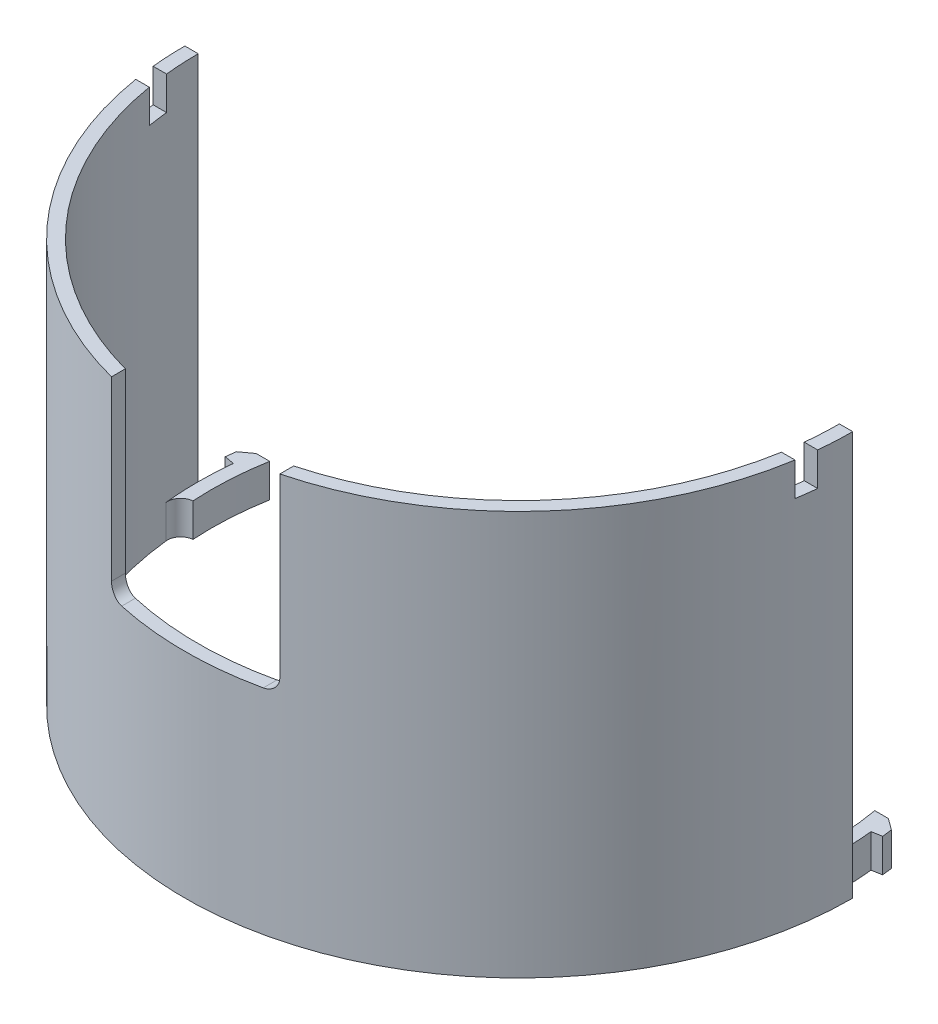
ISO-10303-21;
HEADER;
FILE_DESCRIPTION(('STEP AP214'),'2;1');
FILE_NAME('part.step','',(''),(''),'','','');
FILE_SCHEMA(('AUTOMOTIVE_DESIGN { 1 0 10303 214 1 1 1 1 }'));
ENDSEC;
DATA;
#1=APPLICATION_CONTEXT('core data for automotive mechanical design processes');
#2=APPLICATION_PROTOCOL_DEFINITION('international standard','automotive_design',2000,#1);
#3=PRODUCT_CONTEXT('',#1,'mechanical');
#4=PRODUCT('Part','Part','',(#3));
#5=PRODUCT_RELATED_PRODUCT_CATEGORY('part','',(#4));
#6=PRODUCT_DEFINITION_FORMATION('','',#4);
#7=PRODUCT_DEFINITION_CONTEXT('part definition',#1,'design');
#8=PRODUCT_DEFINITION('design','',#6,#7);
#9=PRODUCT_DEFINITION_SHAPE('','',#8);
#10=(LENGTH_UNIT() NAMED_UNIT(*) SI_UNIT(.MILLI.,.METRE.));
#11=(NAMED_UNIT(*) PLANE_ANGLE_UNIT() SI_UNIT($,.RADIAN.));
#12=(NAMED_UNIT(*) SI_UNIT($,.STERADIAN.) SOLID_ANGLE_UNIT());
#13=UNCERTAINTY_MEASURE_WITH_UNIT(LENGTH_MEASURE(1.E-05),#10,'distance_accuracy_value','');
#14=(GEOMETRIC_REPRESENTATION_CONTEXT(3) GLOBAL_UNCERTAINTY_ASSIGNED_CONTEXT((#13)) GLOBAL_UNIT_ASSIGNED_CONTEXT((#10,
#11,#12)) REPRESENTATION_CONTEXT('',''));
#15=CARTESIAN_POINT('',(0.,0.,0.));
#16=DIRECTION('',(0.,0.,1.));
#17=DIRECTION('',(1.,0.,0.));
#18=AXIS2_PLACEMENT_3D('',#15,#16,#17);
#19=CARTESIAN_POINT('',(0.,60.5,0.));
#20=DIRECTION('',(0.,1.,0.));
#21=DIRECTION('',(0.,0.,1.));
#22=AXIS2_PLACEMENT_3D('',#19,#20,#21);
#23=PLANE('',#22);
#24=DIRECTION('',(0.,0.,1.));
#25=VECTOR('',#24,1.);
#26=CARTESIAN_POINT('',(-12.6,60.5,46.3167356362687));
#27=LINE('',#26,#25);
#28=CARTESIAN_POINT('',(-12.6,60.5,46.3167356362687));
#29=VERTEX_POINT('',#28);
#30=CARTESIAN_POINT('',(-12.6,60.5,48.3863617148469));
#31=VERTEX_POINT('',#30);
#32=EDGE_CURVE('E306',#29,#31,#27,.T.);
#33=ORIENTED_EDGE('',*,*,#32,.F.);
#34=CARTESIAN_POINT('',(0.,60.5,0.));
#35=DIRECTION('',(0.,-1.,0.));
#36=DIRECTION('',(0.,0.,1.));
#37=AXIS2_PLACEMENT_3D('',#34,#35,#36);
#38=CIRCLE('',#37,48.);
#39=CARTESIAN_POINT('',(-47.3286382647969,60.5,8.));
#40=VERTEX_POINT('',#39);
#41=EDGE_CURVE('E323',#29,#40,#38,.T.);
#42=ORIENTED_EDGE('',*,*,#41,.T.);
#43=DIRECTION('',(1.,0.,0.));
#44=VECTOR('',#43,1.);
#45=CARTESIAN_POINT('',(0.,60.5,8.));
#46=LINE('',#45,#44);
#47=CARTESIAN_POINT('',(-49.3558507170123,60.5,8.));
#48=VERTEX_POINT('',#47);
#49=EDGE_CURVE('E545',#48,#40,#46,.T.);
#50=ORIENTED_EDGE('',*,*,#49,.F.);
#51=CARTESIAN_POINT('',(0.,60.5,0.));
#52=DIRECTION('',(0.,1.,0.));
#53=DIRECTION('',(0.,0.,1.));
#54=AXIS2_PLACEMENT_3D('',#51,#52,#53);
#55=CIRCLE('',#54,50.);
#56=EDGE_CURVE('E340',#48,#31,#55,.T.);
#57=ORIENTED_EDGE('',*,*,#56,.T.);
#58=EDGE_LOOP('',(#33,#42,#50,#57));
#59=FACE_BOUND('',#58,.T.);
#60=ADVANCED_FACE('F32',(#59),#23,.T.);
#61=DIRECTION('',(-1.,0.,0.));
#62=VECTOR('',#61,1.);
#63=CARTESIAN_POINT('',(49.749371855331,60.5,5.00000000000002));
#64=LINE('',#63,#62);
#65=CARTESIAN_POINT('',(49.749371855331,60.5,5.00000000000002));
#66=VERTEX_POINT('',#65);
#67=CARTESIAN_POINT('',(47.7388730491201,60.5,5.00000000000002));
#68=VERTEX_POINT('',#67);
#69=EDGE_CURVE('E378',#66,#68,#64,.T.);
#70=ORIENTED_EDGE('',*,*,#69,.F.);
#71=CARTESIAN_POINT('',(50.,60.5,0.));
#72=VERTEX_POINT('',#71);
#73=EDGE_CURVE('E547',#66,#72,#55,.T.);
#74=ORIENTED_EDGE('',*,*,#73,.T.);
#75=DIRECTION('',(-1.,0.,0.));
#76=VECTOR('',#75,1.);
#77=CARTESIAN_POINT('',(48.,60.5,0.));
#78=LINE('',#77,#76);
#79=CARTESIAN_POINT('',(48.,60.5,0.));
#80=VERTEX_POINT('',#79);
#81=EDGE_CURVE('E330',#72,#80,#78,.T.);
#82=ORIENTED_EDGE('',*,*,#81,.T.);
#83=EDGE_CURVE('E322',#80,#68,#38,.T.);
#84=ORIENTED_EDGE('',*,*,#83,.T.);
#85=EDGE_LOOP('',(#70,#74,#82,#84));
#86=FACE_BOUND('',#85,.T.);
#87=ADVANCED_FACE('F730',(#86),#23,.T.);
#88=DIRECTION('',(-1.,0.,0.));
#89=VECTOR('',#88,1.);
#90=CARTESIAN_POINT('',(0.,60.5,5.00000000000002));
#91=LINE('',#90,#89);
#92=CARTESIAN_POINT('',(-47.7388730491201,60.5,5.));
#93=VERTEX_POINT('',#92);
#94=CARTESIAN_POINT('',(-49.749371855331,60.5,5.));
#95=VERTEX_POINT('',#94);
#96=EDGE_CURVE('E571',#93,#95,#91,.T.);
#97=ORIENTED_EDGE('',*,*,#96,.F.);
#98=CARTESIAN_POINT('',(-48.,60.5,0.));
#99=VERTEX_POINT('',#98);
#100=EDGE_CURVE('E325',#93,#99,#38,.T.);
#101=ORIENTED_EDGE('',*,*,#100,.T.);
#102=DIRECTION('',(-1.,0.,0.));
#103=VECTOR('',#102,1.);
#104=CARTESIAN_POINT('',(-50.,60.5,0.));
#105=LINE('',#104,#103);
#106=CARTESIAN_POINT('',(-50.,60.5,0.));
#107=VERTEX_POINT('',#106);
#108=EDGE_CURVE('E327',#99,#107,#105,.T.);
#109=ORIENTED_EDGE('',*,*,#108,.T.);
#110=EDGE_CURVE('E335',#107,#95,#55,.T.);
#111=ORIENTED_EDGE('',*,*,#110,.T.);
#112=EDGE_LOOP('',(#97,#101,#109,#111));
#113=FACE_BOUND('',#112,.T.);
#114=ADVANCED_FACE('F696',(#113),#23,.T.);
#115=CARTESIAN_POINT('',(0.,60.5,0.));
#116=DIRECTION('',(0.,-1.,0.));
#117=DIRECTION('',(0.,0.,-1.));
#118=AXIS2_PLACEMENT_3D('',#115,#116,#117);
#119=CYLINDRICAL_SURFACE('',#118,50.);
#120=CARTESIAN_POINT('',(0.,32.,0.));
#121=DIRECTION('',(0.,1.,0.));
#122=DIRECTION('',(0.,0.,1.));
#123=AXIS2_PLACEMENT_3D('',#120,#121,#122);
#124=CIRCLE('',#123,50.);
#125=CARTESIAN_POINT('',(-10.6,32.,48.8634832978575));
#126=VERTEX_POINT('',#125);
#127=CARTESIAN_POINT('',(10.6,32.,48.8634832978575));
#128=VERTEX_POINT('',#127);
#129=EDGE_CURVE('E512',#126,#128,#124,.T.);
#130=ORIENTED_EDGE('',*,*,#129,.F.);
#131=CARTESIAN_POINT('',(-10.6,32.,48.8634832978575));
#132=CARTESIAN_POINT('',(-10.6575395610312,32.0000010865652,48.8510017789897));
#133=CARTESIAN_POINT('',(-10.7150286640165,32.0024845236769,48.8384234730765));
#134=CARTESIAN_POINT('',(-10.8295533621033,32.0123852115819,48.8131560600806));
#135=CARTESIAN_POINT('',(-10.8865889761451,32.019802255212,48.8004669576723));
#136=CARTESIAN_POINT('',(-11.056364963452,32.049385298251,48.7623849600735));
#137=CARTESIAN_POINT('',(-11.1679071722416,32.0788833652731,48.7369485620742));
#138=CARTESIAN_POINT('',(-11.38442869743,32.1566528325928,48.6868275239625));
#139=CARTESIAN_POINT('',(-11.4894046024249,32.2049338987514,48.6621432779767));
#140=CARTESIAN_POINT('',(-11.6897615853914,32.3190193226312,48.6144019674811));
#141=CARTESIAN_POINT('',(-11.7851452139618,32.3848190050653,48.5913444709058));
#142=CARTESIAN_POINT('',(-11.9628391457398,32.5317127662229,48.5479021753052));
#143=CARTESIAN_POINT('',(-12.0452366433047,32.6126960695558,48.527499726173));
#144=CARTESIAN_POINT('',(-12.1951929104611,32.7881140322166,48.4900325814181));
#145=CARTESIAN_POINT('',(-12.2627501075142,32.8825501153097,48.4729682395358));
#146=CARTESIAN_POINT('',(-12.3792573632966,33.0796587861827,48.4433434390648));
#147=CARTESIAN_POINT('',(-12.4286309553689,33.182065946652,48.4306809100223));
#148=CARTESIAN_POINT('',(-12.5093858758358,33.3941256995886,48.4098855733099));
#149=CARTESIAN_POINT('',(-12.5407859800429,33.5037705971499,48.4017480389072));
#150=CARTESIAN_POINT('',(-12.5750698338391,33.6786319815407,48.3928483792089));
#151=CARTESIAN_POINT('',(-12.5844129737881,33.7425668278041,48.3904186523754));
#152=CARTESIAN_POINT('',(-12.5968760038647,33.8709903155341,48.3871752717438));
#153=CARTESIAN_POINT('',(-12.6000045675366,33.9354780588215,48.3863593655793));
#154=CARTESIAN_POINT('',(-12.6,34.,48.3863617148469));
#155=B_SPLINE_CURVE_WITH_KNOTS('',3,(#131,#132,#133,#134,#135,#136,#137,#138,#139,#140,#141,
#142,#143,#144,#145,#146,#147,#148,#149,#150,#151,#152,#153,#154),.UNSPECIFIED.,.F.,.F.,(4,2,2,
2,2,2,2,2,2,2,2,4),(0.,0.176523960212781,0.353040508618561,0.705671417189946,1.05848403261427,
1.411202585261,1.76144144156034,2.1117173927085,2.45322314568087,2.79437149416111,
2.9880600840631,3.18147815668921),.UNSPECIFIED.);
#156=CARTESIAN_POINT('',(-12.6,34.,48.3863617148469));
#157=VERTEX_POINT('',#156);
#158=EDGE_CURVE('E610',#126,#157,#155,.T.);
#159=ORIENTED_EDGE('',*,*,#158,.T.);
#160=DIRECTION('',(0.,-1.,0.));
#161=VECTOR('',#160,1.);
#162=CARTESIAN_POINT('',(-12.6,60.5,48.3863617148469));
#163=LINE('',#162,#161);
#164=EDGE_CURVE('E528',#157,#31,#163,.F.);
#165=ORIENTED_EDGE('',*,*,#164,.T.);
#166=ORIENTED_EDGE('',*,*,#56,.F.);
#167=DIRECTION('',(0.,-1.,0.));
#168=VECTOR('',#167,1.);
#169=CARTESIAN_POINT('',(-49.3558507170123,60.5,8.));
#170=LINE('',#169,#168);
#171=CARTESIAN_POINT('',(-49.3558507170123,55.5,8.));
#172=VERTEX_POINT('',#171);
#173=EDGE_CURVE('E350',#48,#172,#170,.T.);
#174=ORIENTED_EDGE('',*,*,#173,.T.);
#175=CARTESIAN_POINT('',(0.,55.5,0.));
#176=DIRECTION('',(0.,1.,0.));
#177=DIRECTION('',(0.,0.,1.));
#178=AXIS2_PLACEMENT_3D('',#175,#176,#177);
#179=CIRCLE('',#178,50.);
#180=CARTESIAN_POINT('',(-49.749371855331,55.5,5.));
#181=VERTEX_POINT('',#180);
#182=EDGE_CURVE('E344',#181,#172,#179,.T.);
#183=ORIENTED_EDGE('',*,*,#182,.F.);
#184=DIRECTION('',(0.,1.,0.));
#185=VECTOR('',#184,1.);
#186=CARTESIAN_POINT('',(-49.749371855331,55.5,5.));
#187=LINE('',#186,#185);
#188=EDGE_CURVE('E353',#181,#95,#187,.T.);
#189=ORIENTED_EDGE('',*,*,#188,.T.);
#190=ORIENTED_EDGE('',*,*,#110,.F.);
#191=DIRECTION('',(0.,-1.,0.));
#192=VECTOR('',#191,1.);
#193=CARTESIAN_POINT('',(-50.,60.5,0.));
#194=LINE('',#193,#192);
#195=CARTESIAN_POINT('',(-50.,0.,0.));
#196=VERTEX_POINT('',#195);
#197=EDGE_CURVE('E560',#107,#196,#194,.T.);
#198=ORIENTED_EDGE('',*,*,#197,.T.);
#199=CARTESIAN_POINT('',(0.,0.,0.));
#200=DIRECTION('',(0.,1.,0.));
#201=DIRECTION('',(0.,0.,1.));
#202=AXIS2_PLACEMENT_3D('',#199,#200,#201);
#203=CIRCLE('',#202,50.);
#204=CARTESIAN_POINT('',(50.,0.,0.));
#205=VERTEX_POINT('',#204);
#206=EDGE_CURVE('E346',#196,#205,#203,.T.);
#207=ORIENTED_EDGE('',*,*,#206,.T.);
#208=DIRECTION('',(0.,-1.,0.));
#209=VECTOR('',#208,1.);
#210=CARTESIAN_POINT('',(50.,60.5,0.));
#211=LINE('',#210,#209);
#212=EDGE_CURVE('E567',#72,#205,#211,.T.);
#213=ORIENTED_EDGE('',*,*,#212,.F.);
#214=ORIENTED_EDGE('',*,*,#73,.F.);
#215=DIRECTION('',(0.,1.,0.));
#216=VECTOR('',#215,1.);
#217=CARTESIAN_POINT('',(49.749371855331,55.5,5.00000000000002));
#218=LINE('',#217,#216);
#219=CARTESIAN_POINT('',(49.749371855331,55.5,5.00000000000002));
#220=VERTEX_POINT('',#219);
#221=EDGE_CURVE('E371',#220,#66,#218,.T.);
#222=ORIENTED_EDGE('',*,*,#221,.F.);
#223=CARTESIAN_POINT('',(0.,55.5,0.));
#224=DIRECTION('',(0.,1.,0.));
#225=DIRECTION('',(0.,0.,1.));
#226=AXIS2_PLACEMENT_3D('',#223,#224,#225);
#227=CIRCLE('',#226,50.);
#228=CARTESIAN_POINT('',(49.3558507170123,55.5,8.00000000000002));
#229=VERTEX_POINT('',#228);
#230=EDGE_CURVE('E363',#229,#220,#227,.T.);
#231=ORIENTED_EDGE('',*,*,#230,.F.);
#232=DIRECTION('',(0.,-1.,0.));
#233=VECTOR('',#232,1.);
#234=CARTESIAN_POINT('',(49.3558507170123,60.5,8.00000000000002));
#235=LINE('',#234,#233);
#236=CARTESIAN_POINT('',(49.3558507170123,60.5,8.00000000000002));
#237=VERTEX_POINT('',#236);
#238=EDGE_CURVE('E368',#229,#237,#235,.F.);
#239=ORIENTED_EDGE('',*,*,#238,.T.);
#240=CARTESIAN_POINT('',(12.6,60.5,48.3863617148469));
#241=VERTEX_POINT('',#240);
#242=EDGE_CURVE('E342',#241,#237,#55,.T.);
#243=ORIENTED_EDGE('',*,*,#242,.F.);
#244=DIRECTION('',(0.,-1.,0.));
#245=VECTOR('',#244,1.);
#246=CARTESIAN_POINT('',(12.6,60.5,48.3863617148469));
#247=LINE('',#246,#245);
#248=CARTESIAN_POINT('',(12.6,34.,48.3863617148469));
#249=VERTEX_POINT('',#248);
#250=EDGE_CURVE('E312',#241,#249,#247,.T.);
#251=ORIENTED_EDGE('',*,*,#250,.T.);
#252=CARTESIAN_POINT('',(12.6,34.,48.3863617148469));
#253=CARTESIAN_POINT('',(12.6000005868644,33.9449839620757,48.3863610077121));
#254=CARTESIAN_POINT('',(12.597728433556,33.8899948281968,48.3869532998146));
#255=CARTESIAN_POINT('',(12.5886702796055,33.7804216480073,48.3893109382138));
#256=CARTESIAN_POINT('',(12.5818848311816,33.7258375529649,48.3910761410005));
#257=CARTESIAN_POINT('',(12.5548523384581,33.5634828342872,48.398099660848));
#258=CARTESIAN_POINT('',(12.527928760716,33.4568185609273,48.4050860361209));
#259=CARTESIAN_POINT('',(12.4571635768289,33.2497070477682,48.4233455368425));
#260=CARTESIAN_POINT('',(12.4133199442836,33.1492605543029,48.4346191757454));
#261=CARTESIAN_POINT('',(12.3101116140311,32.9572162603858,48.4609531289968));
#262=CARTESIAN_POINT('',(12.2507451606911,32.8656194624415,48.4760138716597));
#263=CARTESIAN_POINT('',(12.117275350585,32.6923222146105,48.509549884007));
#264=CARTESIAN_POINT('',(12.042961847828,32.6107932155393,48.5280735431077));
#265=CARTESIAN_POINT('',(11.8823340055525,32.4612787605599,48.5676535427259));
#266=CARTESIAN_POINT('',(11.7960164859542,32.3932969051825,48.5887105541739));
#267=CARTESIAN_POINT('',(11.6110501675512,32.2707073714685,48.6332480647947));
#268=CARTESIAN_POINT('',(11.512111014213,32.2165574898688,48.6567820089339));
#269=CARTESIAN_POINT('',(11.3067835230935,32.1256863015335,48.704904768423));
#270=CARTESIAN_POINT('',(11.2003973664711,32.0889599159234,48.7294932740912));
#271=CARTESIAN_POINT('',(11.011444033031,32.04102390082,48.772480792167));
#272=CARTESIAN_POINT('',(10.9298916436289,32.0256593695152,48.7908235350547));
#273=CARTESIAN_POINT('',(10.7655853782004,32.0051464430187,48.8273421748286));
#274=CARTESIAN_POINT('',(10.6828331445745,31.9999852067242,48.8455182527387));
#275=CARTESIAN_POINT('',(10.6,32.,48.8634832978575));
#276=B_SPLINE_CURVE_WITH_KNOTS('',3,(#252,#253,#254,#255,#256,#257,#258,#259,#260,#261,#262,
#263,#264,#265,#266,#267,#268,#269,#270,#271,#272,#273,#274,#275),.UNSPECIFIED.,.F.,.F.,(4,2,2,
2,2,2,2,2,2,2,2,4),(0.,0.164944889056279,0.329869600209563,0.658856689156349,0.98788319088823,
1.31694692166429,1.65100888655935,1.98515951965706,2.32924627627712,2.67323267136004,
2.92760799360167,3.1816629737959),.UNSPECIFIED.);
#277=EDGE_CURVE('E645',#249,#128,#276,.T.);
#278=ORIENTED_EDGE('',*,*,#277,.T.);
#279=EDGE_LOOP('',(#130,#159,#165,#166,#174,#183,#189,#190,#198,#207,#213,#214,#222,#231,#239,
#243,#251,#278));
#280=FACE_BOUND('',#279,.T.);
#281=ADVANCED_FACE('F623',(#280),#119,.T.);
#282=CARTESIAN_POINT('',(48.,60.5,0.));
#283=DIRECTION('',(0.,0.,1.));
#284=DIRECTION('',(1.,0.,0.));
#285=AXIS2_PLACEMENT_3D('',#282,#283,#284);
#286=PLANE('',#285);
#287=DIRECTION('',(-1.,0.,0.));
#288=VECTOR('',#287,1.);
#289=CARTESIAN_POINT('',(48.,0.,0.));
#290=LINE('',#289,#288);
#291=CARTESIAN_POINT('',(48.,0.,0.));
#292=VERTEX_POINT('',#291);
#293=EDGE_CURVE('E663',#205,#292,#290,.T.);
#294=ORIENTED_EDGE('',*,*,#293,.T.);
#295=DIRECTION('',(0.,-1.,0.));
#296=VECTOR('',#295,1.);
#297=CARTESIAN_POINT('',(48.,5.,0.));
#298=LINE('',#297,#296);
#299=CARTESIAN_POINT('',(48.,5.,0.));
#300=VERTEX_POINT('',#299);
#301=EDGE_CURVE('E380',#292,#300,#298,.F.);
#302=ORIENTED_EDGE('',*,*,#301,.T.);
#303=DIRECTION('',(0.,-1.,0.));
#304=VECTOR('',#303,1.);
#305=CARTESIAN_POINT('',(48.,60.5,0.));
#306=LINE('',#305,#304);
#307=EDGE_CURVE('E565',#80,#300,#306,.T.);
#308=ORIENTED_EDGE('',*,*,#307,.F.);
#309=ORIENTED_EDGE('',*,*,#81,.F.);
#310=ORIENTED_EDGE('',*,*,#212,.T.);
#311=EDGE_LOOP('',(#294,#302,#308,#309,#310));
#312=FACE_BOUND('',#311,.T.);
#313=ADVANCED_FACE('F728',(#312),#286,.F.);
#314=CARTESIAN_POINT('',(0.,60.5,0.));
#315=DIRECTION('',(0.,-1.,0.));
#316=DIRECTION('',(0.,0.,-1.));
#317=AXIS2_PLACEMENT_3D('',#314,#315,#316);
#318=CYLINDRICAL_SURFACE('',#317,48.);
#319=CARTESIAN_POINT('',(0.,5.,0.));
#320=DIRECTION('',(0.,-1.,0.));
#321=DIRECTION('',(0.,0.,1.));
#322=AXIS2_PLACEMENT_3D('',#319,#320,#321);
#323=CIRCLE('',#322,48.);
#324=CARTESIAN_POINT('',(47.7304743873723,5.,5.07954867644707));
#325=VERTEX_POINT('',#324);
#326=EDGE_CURVE('E47',#300,#325,#323,.T.);
#327=ORIENTED_EDGE('',*,*,#326,.T.);
#328=DIRECTION('',(0.,-1.,0.));
#329=VECTOR('',#328,1.);
#330=CARTESIAN_POINT('',(47.7304743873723,60.5,5.07954867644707));
#331=LINE('',#330,#329);
#332=CARTESIAN_POINT('',(47.7304743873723,0.,5.07954867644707));
#333=VERTEX_POINT('',#332);
#334=EDGE_CURVE('E608',#325,#333,#331,.T.);
#335=ORIENTED_EDGE('',*,*,#334,.T.);
#336=CARTESIAN_POINT('',(0.,0.,0.));
#337=DIRECTION('',(0.,-1.,0.));
#338=DIRECTION('',(0.,0.,1.));
#339=AXIS2_PLACEMENT_3D('',#336,#337,#338);
#340=CIRCLE('',#339,48.);
#341=CARTESIAN_POINT('',(16.,0.,45.254833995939));
#342=VERTEX_POINT('',#341);
#343=EDGE_CURVE('E551',#333,#342,#340,.T.);
#344=ORIENTED_EDGE('',*,*,#343,.T.);
#345=DIRECTION('',(0.,-1.,0.));
#346=VECTOR('',#345,1.);
#347=CARTESIAN_POINT('',(16.,5.,45.254833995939));
#348=LINE('',#347,#346);
#349=CARTESIAN_POINT('',(16.,5.,45.254833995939));
#350=VERTEX_POINT('',#349);
#351=EDGE_CURVE('E470',#350,#342,#348,.T.);
#352=ORIENTED_EDGE('',*,*,#351,.F.);
#353=CARTESIAN_POINT('',(0.,5.,0.));
#354=DIRECTION('',(0.,-1.,0.));
#355=DIRECTION('',(0.,0.,-1.));
#356=AXIS2_PLACEMENT_3D('',#353,#354,#355);
#357=CIRCLE('',#356,48.);
#358=CARTESIAN_POINT('',(-16.,5.,45.254833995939));
#359=VERTEX_POINT('',#358);
#360=EDGE_CURVE('E500',#350,#359,#357,.T.);
#361=ORIENTED_EDGE('',*,*,#360,.T.);
#362=DIRECTION('',(0.,-1.,0.));
#363=VECTOR('',#362,1.);
#364=CARTESIAN_POINT('',(-16.,5.,45.254833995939));
#365=LINE('',#364,#363);
#366=CARTESIAN_POINT('',(-16.,0.,45.254833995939));
#367=VERTEX_POINT('',#366);
#368=EDGE_CURVE('E486',#359,#367,#365,.T.);
#369=ORIENTED_EDGE('',*,*,#368,.T.);
#370=CARTESIAN_POINT('',(-47.7304743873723,0.,5.07954867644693));
#371=VERTEX_POINT('',#370);
#372=EDGE_CURVE('E556',#367,#371,#340,.T.);
#373=ORIENTED_EDGE('',*,*,#372,.T.);
#374=DIRECTION('',(0.,-1.,0.));
#375=VECTOR('',#374,1.);
#376=CARTESIAN_POINT('',(-47.7304743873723,60.5,5.07954867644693));
#377=LINE('',#376,#375);
#378=CARTESIAN_POINT('',(-47.7304743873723,5.,5.07954867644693));
#379=VERTEX_POINT('',#378);
#380=EDGE_CURVE('E606',#371,#379,#377,.F.);
#381=ORIENTED_EDGE('',*,*,#380,.T.);
#382=CARTESIAN_POINT('',(0.,5.,0.));
#383=DIRECTION('',(0.,-1.,0.));
#384=DIRECTION('',(0.,0.,-1.));
#385=AXIS2_PLACEMENT_3D('',#382,#383,#384);
#386=CIRCLE('',#385,48.);
#387=CARTESIAN_POINT('',(-48.,5.,0.));
#388=VERTEX_POINT('',#387);
#389=EDGE_CURVE('E54',#379,#388,#386,.T.);
#390=ORIENTED_EDGE('',*,*,#389,.T.);
#391=DIRECTION('',(0.,-1.,0.));
#392=VECTOR('',#391,1.);
#393=CARTESIAN_POINT('',(-48.,60.5,0.));
#394=LINE('',#393,#392);
#395=EDGE_CURVE('E562',#99,#388,#394,.T.);
#396=ORIENTED_EDGE('',*,*,#395,.F.);
#397=ORIENTED_EDGE('',*,*,#100,.F.);
#398=DIRECTION('',(0.,-1.,0.));
#399=VECTOR('',#398,1.);
#400=CARTESIAN_POINT('',(-47.7388730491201,60.5,5.));
#401=LINE('',#400,#399);
#402=CARTESIAN_POINT('',(-47.7388730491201,55.5,5.));
#403=VERTEX_POINT('',#402);
#404=EDGE_CURVE('E347',#93,#403,#401,.T.);
#405=ORIENTED_EDGE('',*,*,#404,.T.);
#406=CARTESIAN_POINT('',(0.,55.5,0.));
#407=DIRECTION('',(0.,1.,0.));
#408=DIRECTION('',(0.,0.,1.));
#409=AXIS2_PLACEMENT_3D('',#406,#407,#408);
#410=CIRCLE('',#409,48.);
#411=CARTESIAN_POINT('',(-47.3286382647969,55.5,8.));
#412=VERTEX_POINT('',#411);
#413=EDGE_CURVE('E573',#412,#403,#410,.F.);
#414=ORIENTED_EDGE('',*,*,#413,.F.);
#415=DIRECTION('',(0.,1.,0.));
#416=VECTOR('',#415,1.);
#417=CARTESIAN_POINT('',(-47.3286382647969,55.5,8.));
#418=LINE('',#417,#416);
#419=EDGE_CURVE('E354',#412,#40,#418,.T.);
#420=ORIENTED_EDGE('',*,*,#419,.T.);
#421=ORIENTED_EDGE('',*,*,#41,.F.);
#422=DIRECTION('',(0.,1.,0.));
#423=VECTOR('',#422,1.);
#424=CARTESIAN_POINT('',(-12.6,32.,46.3167356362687));
#425=LINE('',#424,#423);
#426=CARTESIAN_POINT('',(-12.6,34.,46.3167356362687));
#427=VERTEX_POINT('',#426);
#428=EDGE_CURVE('E305',#427,#29,#425,.T.);
#429=ORIENTED_EDGE('',*,*,#428,.F.);
#430=CARTESIAN_POINT('',(-12.6,34.,46.3167356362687));
#431=CARTESIAN_POINT('',(-12.6000006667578,33.9450920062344,46.3167348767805));
#432=CARTESIAN_POINT('',(-12.597737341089,33.8902109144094,46.3173512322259));
#433=CARTESIAN_POINT('',(-12.5887149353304,33.7808540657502,46.319804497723));
#434=CARTESIAN_POINT('',(-12.5819564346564,33.7263782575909,46.321641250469));
#435=CARTESIAN_POINT('',(-12.5550340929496,33.5643563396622,46.3289486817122));
#436=CARTESIAN_POINT('',(-12.5282230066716,33.4579160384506,46.3362166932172));
#437=CARTESIAN_POINT('',(-12.4577692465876,33.2512459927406,46.3552078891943));
#438=CARTESIAN_POINT('',(-12.41412508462,33.1510167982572,46.3669314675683));
#439=CARTESIAN_POINT('',(-12.3114082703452,32.9593762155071,46.3943104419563));
#440=CARTESIAN_POINT('',(-12.2523334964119,32.8679660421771,46.409966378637));
#441=CARTESIAN_POINT('',(-12.119460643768,32.6948788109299,46.4448431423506));
#442=CARTESIAN_POINT('',(-12.045436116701,32.6133868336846,46.46411843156));
#443=CARTESIAN_POINT('',(-11.8854433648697,32.4638923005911,46.5053013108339));
#444=CARTESIAN_POINT('',(-11.7994719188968,32.3958933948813,46.5272096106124));
#445=CARTESIAN_POINT('',(-11.6150142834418,32.2730311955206,46.573605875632));
#446=CARTESIAN_POINT('',(-11.5162134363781,32.2186634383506,46.5981543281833));
#447=CARTESIAN_POINT('',(-11.3111446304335,32.1273379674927,46.6483561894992));
#448=CARTESIAN_POINT('',(-11.2048786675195,32.0903756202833,46.6740093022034));
#449=CARTESIAN_POINT('',(-11.0153128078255,32.041807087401,46.7190519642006));
#450=CARTESIAN_POINT('',(-10.9330116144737,32.0261501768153,46.7383826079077));
#451=CARTESIAN_POINT('',(-10.7671678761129,32.005245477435,46.7768686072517));
#452=CARTESIAN_POINT('',(-10.683627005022,31.9999847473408,46.7960241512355));
#453=CARTESIAN_POINT('',(-10.6,32.,46.8149548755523));
#454=B_SPLINE_CURVE_WITH_KNOTS('',3,(#430,#431,#432,#433,#434,#435,#436,#437,#438,#439,#440,
#441,#442,#443,#444,#445,#446,#447,#448,#449,#450,#451,#452,#453),.UNSPECIFIED.,.F.,.F.,(4,2,2,
2,2,2,2,2,2,2,2,4),(0.,0.164620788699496,0.329220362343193,0.657532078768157,0.985872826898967,
1.31425874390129,1.64805266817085,1.9819367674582,2.32661129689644,2.67119401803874,
2.92851750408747,3.18552046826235),.UNSPECIFIED.);
#455=CARTESIAN_POINT('',(-10.6,32.,46.8149548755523));
#456=VERTEX_POINT('',#455);
#457=EDGE_CURVE('E617',#427,#456,#454,.T.);
#458=ORIENTED_EDGE('',*,*,#457,.T.);
#459=CARTESIAN_POINT('',(0.,32.,0.));
#460=DIRECTION('',(0.,1.,0.));
#461=DIRECTION('',(0.,0.,1.));
#462=AXIS2_PLACEMENT_3D('',#459,#460,#461);
#463=CIRCLE('',#462,48.);
#464=CARTESIAN_POINT('',(10.6,32.,46.8149548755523));
#465=VERTEX_POINT('',#464);
#466=EDGE_CURVE('E315',#465,#456,#463,.F.);
#467=ORIENTED_EDGE('',*,*,#466,.F.);
#468=CARTESIAN_POINT('',(10.6,32.,46.8149548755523));
#469=CARTESIAN_POINT('',(10.6576539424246,32.0000011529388,46.801901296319));
#470=CARTESIAN_POINT('',(10.715255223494,32.0024943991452,46.7887462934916));
#471=CARTESIAN_POINT('',(10.8299994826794,32.0124335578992,46.7623199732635));
#472=CARTESIAN_POINT('',(10.8871424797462,32.0198792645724,46.7490486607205));
#473=CARTESIAN_POINT('',(11.0572376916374,32.0495764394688,46.7092174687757));
#474=CARTESIAN_POINT('',(11.1689837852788,32.0791881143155,46.6826114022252));
#475=CARTESIAN_POINT('',(11.3858881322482,32.1572600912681,46.63018382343));
#476=CARTESIAN_POINT('',(11.4910429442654,32.2057301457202,46.604362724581));
#477=CARTESIAN_POINT('',(11.6917232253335,32.3202752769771,46.5544229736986));
#478=CARTESIAN_POINT('',(11.7872513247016,32.386345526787,46.5303038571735));
#479=CARTESIAN_POINT('',(11.9651231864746,32.5338192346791,46.4848814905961));
#480=CARTESIAN_POINT('',(12.0475625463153,32.6151010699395,46.4635580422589));
#481=CARTESIAN_POINT('',(12.1975424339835,32.7911881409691,46.4244114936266));
#482=CARTESIAN_POINT('',(12.2650815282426,32.8859946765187,46.4065887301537));
#483=CARTESIAN_POINT('',(12.3813280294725,33.0836677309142,46.3757075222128));
#484=CARTESIAN_POINT('',(12.4304992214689,33.1862435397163,46.3625322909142));
#485=CARTESIAN_POINT('',(12.510817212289,33.3986411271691,46.3409236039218));
#486=CARTESIAN_POINT('',(12.5419835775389,33.5084548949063,46.3324850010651));
#487=CARTESIAN_POINT('',(12.5756995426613,33.6826925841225,46.3233410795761));
#488=CARTESIAN_POINT('',(12.5848067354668,33.7458270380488,46.3208668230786));
#489=CARTESIAN_POINT('',(12.5969548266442,33.8726302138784,46.3175641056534));
#490=CARTESIAN_POINT('',(12.6000041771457,33.9362980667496,46.3167333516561));
#491=CARTESIAN_POINT('',(12.6,34.,46.3167356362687));
#492=B_SPLINE_CURVE_WITH_KNOTS('',3,(#468,#469,#470,#471,#472,#473,#474,#475,#476,#477,#478,
#479,#480,#481,#482,#483,#484,#485,#486,#487,#488,#489,#490,#491),.UNSPECIFIED.,.F.,.F.,(4,2,2,
2,2,2,2,2,2,2,2,4),(0.,0.177229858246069,0.35445234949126,0.70850961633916,1.06275022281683,
1.41689377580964,1.76831822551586,2.11977647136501,2.46163953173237,2.80313037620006,
2.99435822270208,3.1853190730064),.UNSPECIFIED.);
#493=CARTESIAN_POINT('',(12.6,34.,46.3167356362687));
#494=VERTEX_POINT('',#493);
#495=EDGE_CURVE('E302',#465,#494,#492,.T.);
#496=ORIENTED_EDGE('',*,*,#495,.T.);
#497=DIRECTION('',(0.,1.,0.));
#498=VECTOR('',#497,1.);
#499=CARTESIAN_POINT('',(12.6,32.,46.3167356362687));
#500=LINE('',#499,#498);
#501=CARTESIAN_POINT('',(12.6,60.5,46.3167356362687));
#502=VERTEX_POINT('',#501);
#503=EDGE_CURVE('E295',#494,#502,#500,.T.);
#504=ORIENTED_EDGE('',*,*,#503,.T.);
#505=CARTESIAN_POINT('',(47.3286382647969,60.5,8.00000000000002));
#506=VERTEX_POINT('',#505);
#507=EDGE_CURVE('E300',#506,#502,#38,.T.);
#508=ORIENTED_EDGE('',*,*,#507,.F.);
#509=DIRECTION('',(0.,1.,0.));
#510=VECTOR('',#509,1.);
#511=CARTESIAN_POINT('',(47.3286382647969,55.5,8.00000000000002));
#512=LINE('',#511,#510);
#513=CARTESIAN_POINT('',(47.3286382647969,55.5,8.00000000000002));
#514=VERTEX_POINT('',#513);
#515=EDGE_CURVE('E372',#514,#506,#512,.T.);
#516=ORIENTED_EDGE('',*,*,#515,.F.);
#517=CARTESIAN_POINT('',(0.,55.5,0.));
#518=DIRECTION('',(0.,1.,0.));
#519=DIRECTION('',(0.,0.,1.));
#520=AXIS2_PLACEMENT_3D('',#517,#518,#519);
#521=CIRCLE('',#520,48.);
#522=CARTESIAN_POINT('',(47.7388730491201,55.5,5.00000000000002));
#523=VERTEX_POINT('',#522);
#524=EDGE_CURVE('E316',#523,#514,#521,.F.);
#525=ORIENTED_EDGE('',*,*,#524,.F.);
#526=DIRECTION('',(0.,-1.,0.));
#527=VECTOR('',#526,1.);
#528=CARTESIAN_POINT('',(47.7388730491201,60.5,5.00000000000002));
#529=LINE('',#528,#527);
#530=EDGE_CURVE('E365',#523,#68,#529,.F.);
#531=ORIENTED_EDGE('',*,*,#530,.T.);
#532=ORIENTED_EDGE('',*,*,#83,.F.);
#533=ORIENTED_EDGE('',*,*,#307,.T.);
#534=EDGE_LOOP('',(#327,#335,#344,#352,#361,#369,#373,#381,#390,#396,#397,#405,#414,#420,#421,
#429,#458,#467,#496,#504,#508,#516,#525,#531,#532,#533));
#535=FACE_BOUND('',#534,.T.);
#536=ADVANCED_FACE('F297',(#535),#318,.F.);
#537=CARTESIAN_POINT('',(-50.,60.5,0.));
#538=DIRECTION('',(0.,0.,1.));
#539=DIRECTION('',(1.,0.,0.));
#540=AXIS2_PLACEMENT_3D('',#537,#538,#539);
#541=PLANE('',#540);
#542=DIRECTION('',(-1.,0.,0.));
#543=VECTOR('',#542,1.);
#544=CARTESIAN_POINT('',(-50.,0.,0.));
#545=LINE('',#544,#543);
#546=CARTESIAN_POINT('',(-48.,0.,0.));
#547=VERTEX_POINT('',#546);
#548=EDGE_CURVE('E548',#547,#196,#545,.T.);
#549=ORIENTED_EDGE('',*,*,#548,.T.);
#550=ORIENTED_EDGE('',*,*,#197,.F.);
#551=ORIENTED_EDGE('',*,*,#108,.F.);
#552=ORIENTED_EDGE('',*,*,#395,.T.);
#553=DIRECTION('',(0.,-1.,0.));
#554=VECTOR('',#553,1.);
#555=CARTESIAN_POINT('',(-48.,5.,0.));
#556=LINE('',#555,#554);
#557=EDGE_CURVE('E418',#388,#547,#556,.T.);
#558=ORIENTED_EDGE('',*,*,#557,.T.);
#559=EDGE_LOOP('',(#549,#550,#551,#552,#558));
#560=FACE_BOUND('',#559,.T.);
#561=ADVANCED_FACE('F689',(#560),#541,.F.);
#562=DIRECTION('',(0.,0.,-1.));
#563=VECTOR('',#562,1.);
#564=CARTESIAN_POINT('',(12.6,60.5,0.));
#565=LINE('',#564,#563);
#566=EDGE_CURVE('E309',#241,#502,#565,.T.);
#567=ORIENTED_EDGE('',*,*,#566,.F.);
#568=ORIENTED_EDGE('',*,*,#242,.T.);
#569=DIRECTION('',(1.,0.,0.));
#570=VECTOR('',#569,1.);
#571=CARTESIAN_POINT('',(49.749371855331,60.5,8.00000000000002));
#572=LINE('',#571,#570);
#573=EDGE_CURVE('E321',#506,#237,#572,.T.);
#574=ORIENTED_EDGE('',*,*,#573,.F.);
#575=ORIENTED_EDGE('',*,*,#507,.T.);
#576=EDGE_LOOP('',(#567,#568,#574,#575));
#577=FACE_BOUND('',#576,.T.);
#578=ADVANCED_FACE('F319',(#577),#23,.T.);
#579=CARTESIAN_POINT('',(0.,0.,0.));
#580=DIRECTION('',(0.,1.,0.));
#581=DIRECTION('',(0.,0.,1.));
#582=AXIS2_PLACEMENT_3D('',#579,#580,#581);
#583=PLANE('',#582);
#584=DIRECTION('',(0.,0.,-1.));
#585=VECTOR('',#584,1.);
#586=CARTESIAN_POINT('',(-16.,0.,45.254833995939));
#587=LINE('',#586,#585);
#588=CARTESIAN_POINT('',(-16.,0.,38.));
#589=VERTEX_POINT('',#588);
#590=EDGE_CURVE('E509',#367,#589,#587,.T.);
#591=ORIENTED_EDGE('',*,*,#590,.T.);
#592=CARTESIAN_POINT('',(-14.,0.,38.));
#593=DIRECTION('',(0.,1.,0.));
#594=DIRECTION('',(0.,0.,1.));
#595=AXIS2_PLACEMENT_3D('',#592,#593,#594);
#596=CIRCLE('',#595,2.);
#597=CARTESIAN_POINT('',(-14.,0.,36.));
#598=VERTEX_POINT('',#597);
#599=EDGE_CURVE('E583',#589,#598,#596,.F.);
#600=ORIENTED_EDGE('',*,*,#599,.T.);
#601=DIRECTION('',(1.,0.,0.));
#602=VECTOR('',#601,1.);
#603=CARTESIAN_POINT('',(-12.,0.,36.));
#604=LINE('',#603,#602);
#605=CARTESIAN_POINT('',(-12.,0.,36.));
#606=VERTEX_POINT('',#605);
#607=EDGE_CURVE('E507',#598,#606,#604,.T.);
#608=ORIENTED_EDGE('',*,*,#607,.T.);
#609=CARTESIAN_POINT('',(0.,0.,33.));
#610=DIRECTION('',(0.,1.,0.));
#611=DIRECTION('',(0.,0.,-1.));
#612=AXIS2_PLACEMENT_3D('',#609,#610,#611);
#613=CIRCLE('',#612,12.369316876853);
#614=CARTESIAN_POINT('',(12.,0.,36.));
#615=VERTEX_POINT('',#614);
#616=EDGE_CURVE('E504',#606,#615,#613,.T.);
#617=ORIENTED_EDGE('',*,*,#616,.T.);
#618=DIRECTION('',(1.,0.,0.));
#619=VECTOR('',#618,1.);
#620=CARTESIAN_POINT('',(16.,0.,36.));
#621=LINE('',#620,#619);
#622=CARTESIAN_POINT('',(14.,0.,36.));
#623=VERTEX_POINT('',#622);
#624=EDGE_CURVE('E501',#615,#623,#621,.T.);
#625=ORIENTED_EDGE('',*,*,#624,.T.);
#626=CARTESIAN_POINT('',(14.,0.,38.));
#627=DIRECTION('',(0.,1.,0.));
#628=DIRECTION('',(0.,0.,1.));
#629=AXIS2_PLACEMENT_3D('',#626,#627,#628);
#630=CIRCLE('',#629,2.);
#631=CARTESIAN_POINT('',(16.,0.,38.));
#632=VERTEX_POINT('',#631);
#633=EDGE_CURVE('E581',#623,#632,#630,.F.);
#634=ORIENTED_EDGE('',*,*,#633,.T.);
#635=DIRECTION('',(0.,0.,1.));
#636=VECTOR('',#635,1.);
#637=CARTESIAN_POINT('',(16.,0.,45.254833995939));
#638=LINE('',#637,#636);
#639=EDGE_CURVE('E497',#632,#342,#638,.T.);
#640=ORIENTED_EDGE('',*,*,#639,.T.);
#641=ORIENTED_EDGE('',*,*,#343,.F.);
#642=CARTESIAN_POINT('',(45.7417046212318,0.,4.86790081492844));
#643=DIRECTION('',(0.,1.,0.));
#644=DIRECTION('',(0.,0.,1.));
#645=AXIS2_PLACEMENT_3D('',#642,#643,#644);
#646=CIRCLE('',#645,2.);
#647=CARTESIAN_POINT('',(45.91006834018,0.,2.875));
#648=VERTEX_POINT('',#647);
#649=EDGE_CURVE('E650',#333,#648,#646,.T.);
#650=ORIENTED_EDGE('',*,*,#649,.T.);
#651=CARTESIAN_POINT('',(0.,0.,0.));
#652=DIRECTION('',(0.,1.,0.));
#653=DIRECTION('',(0.,0.,1.));
#654=AXIS2_PLACEMENT_3D('',#651,#652,#653);
#655=CIRCLE('',#654,46.);
#656=CARTESIAN_POINT('',(45.2990066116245,0.,-8.));
#657=VERTEX_POINT('',#656);
#658=EDGE_CURVE('E412',#648,#657,#655,.T.);
#659=ORIENTED_EDGE('',*,*,#658,.T.);
#660=DIRECTION('',(1.,0.,0.));
#661=VECTOR('',#660,1.);
#662=CARTESIAN_POINT('',(45.2990066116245,0.,-8.));
#663=LINE('',#662,#661);
#664=CARTESIAN_POINT('',(47.328638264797,0.,-8.));
#665=VERTEX_POINT('',#664);
#666=EDGE_CURVE('E409',#657,#665,#663,.T.);
#667=ORIENTED_EDGE('',*,*,#666,.T.);
#668=DIRECTION('',(0.807135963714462,0.,0.590365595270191));
#669=VECTOR('',#668,1.);
#670=CARTESIAN_POINT('',(47.328638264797,0.,-8.));
#671=LINE('',#670,#669);
#672=CARTESIAN_POINT('',(49.0376131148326,0.,-6.75));
#673=VERTEX_POINT('',#672);
#674=EDGE_CURVE('E406',#665,#673,#671,.T.);
#675=ORIENTED_EDGE('',*,*,#674,.T.);
#676=DIRECTION('',(0.121338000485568,0.,0.992611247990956));
#677=VECTOR('',#676,1.);
#678=CARTESIAN_POINT('',(49.0376131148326,0.,-6.75));
#679=LINE('',#678,#677);
#680=CARTESIAN_POINT('',(49.2196201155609,0.,-5.26108312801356));
#681=VERTEX_POINT('',#680);
#682=EDGE_CURVE('E403',#673,#681,#679,.T.);
#683=ORIENTED_EDGE('',*,*,#682,.T.);
#684=DIRECTION('',(-0.984809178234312,0.,0.173640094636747));
#685=VECTOR('',#684,1.);
#686=CARTESIAN_POINT('',(49.2196201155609,0.,-5.26108312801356));
#687=LINE('',#686,#685);
#688=CARTESIAN_POINT('',(47.7388730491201,0.,-5.));
#689=VERTEX_POINT('',#688);
#690=EDGE_CURVE('E400',#681,#689,#687,.T.);
#691=ORIENTED_EDGE('',*,*,#690,.T.);
#692=CARTESIAN_POINT('',(0.,0.,0.));
#693=DIRECTION('',(0.,-1.,0.));
#694=DIRECTION('',(0.,0.,1.));
#695=AXIS2_PLACEMENT_3D('',#692,#693,#694);
#696=CIRCLE('',#695,48.);
#697=EDGE_CURVE('E415',#689,#292,#696,.T.);
#698=ORIENTED_EDGE('',*,*,#697,.T.);
#699=ORIENTED_EDGE('',*,*,#293,.F.);
#700=ORIENTED_EDGE('',*,*,#206,.F.);
#701=ORIENTED_EDGE('',*,*,#548,.F.);
#702=CARTESIAN_POINT('',(0.,0.,0.));
#703=DIRECTION('',(0.,-1.,0.));
#704=DIRECTION('',(0.,0.,-1.));
#705=AXIS2_PLACEMENT_3D('',#702,#703,#704);
#706=CIRCLE('',#705,48.);
#707=CARTESIAN_POINT('',(-47.7388730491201,0.,-5.00000000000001));
#708=VERTEX_POINT('',#707);
#709=EDGE_CURVE('E468',#547,#708,#706,.T.);
#710=ORIENTED_EDGE('',*,*,#709,.T.);
#711=DIRECTION('',(-0.984809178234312,0.,-0.173640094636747));
#712=VECTOR('',#711,1.);
#713=CARTESIAN_POINT('',(-49.2196201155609,0.,-5.26108312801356));
#714=LINE('',#713,#712);
#715=CARTESIAN_POINT('',(-49.2196201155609,0.,-5.26108312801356));
#716=VERTEX_POINT('',#715);
#717=EDGE_CURVE('E465',#708,#716,#714,.T.);
#718=ORIENTED_EDGE('',*,*,#717,.T.);
#719=DIRECTION('',(0.121338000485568,0.,-0.992611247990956));
#720=VECTOR('',#719,1.);
#721=CARTESIAN_POINT('',(-49.0376131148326,0.,-6.75));
#722=LINE('',#721,#720);
#723=CARTESIAN_POINT('',(-49.0376131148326,0.,-6.75));
#724=VERTEX_POINT('',#723);
#725=EDGE_CURVE('E462',#716,#724,#722,.T.);
#726=ORIENTED_EDGE('',*,*,#725,.T.);
#727=DIRECTION('',(0.807135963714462,0.,-0.590365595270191));
#728=VECTOR('',#727,1.);
#729=CARTESIAN_POINT('',(-47.328638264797,0.,-8.));
#730=LINE('',#729,#728);
#731=CARTESIAN_POINT('',(-47.328638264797,0.,-8.));
#732=VERTEX_POINT('',#731);
#733=EDGE_CURVE('E459',#724,#732,#730,.T.);
#734=ORIENTED_EDGE('',*,*,#733,.T.);
#735=DIRECTION('',(1.,0.,0.));
#736=VECTOR('',#735,1.);
#737=CARTESIAN_POINT('',(-45.2990066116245,0.,-8.));
#738=LINE('',#737,#736);
#739=CARTESIAN_POINT('',(-45.2990066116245,0.,-8.));
#740=VERTEX_POINT('',#739);
#741=EDGE_CURVE('E456',#732,#740,#738,.T.);
#742=ORIENTED_EDGE('',*,*,#741,.T.);
#743=CARTESIAN_POINT('',(0.,0.,0.));
#744=DIRECTION('',(0.,1.,0.));
#745=DIRECTION('',(0.,0.,-1.));
#746=AXIS2_PLACEMENT_3D('',#743,#744,#745);
#747=CIRCLE('',#746,46.);
#748=CARTESIAN_POINT('',(-45.91006834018,0.,2.875));
#749=VERTEX_POINT('',#748);
#750=EDGE_CURVE('E452',#740,#749,#747,.T.);
#751=ORIENTED_EDGE('',*,*,#750,.T.);
#752=CARTESIAN_POINT('',(-45.7417046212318,0.,4.86790081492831));
#753=DIRECTION('',(0.,1.,0.));
#754=DIRECTION('',(0.,0.,1.));
#755=AXIS2_PLACEMENT_3D('',#752,#753,#754);
#756=CIRCLE('',#755,2.);
#757=EDGE_CURVE('E40',#749,#371,#756,.T.);
#758=ORIENTED_EDGE('',*,*,#757,.T.);
#759=ORIENTED_EDGE('',*,*,#372,.F.);
#760=EDGE_LOOP('',(#591,#600,#608,#617,#625,#634,#640,#641,#650,#659,#667,#675,#683,#691,#698,
#699,#700,#701,#710,#718,#726,#734,#742,#751,#758,#759));
#761=FACE_BOUND('',#760,.T.);
#762=ADVANCED_FACE('F655',(#761),#583,.F.);
#763=CARTESIAN_POINT('',(0.,55.5,0.));
#764=DIRECTION('',(0.,1.,0.));
#765=DIRECTION('',(0.,0.,1.));
#766=AXIS2_PLACEMENT_3D('',#763,#764,#765);
#767=PLANE('',#766);
#768=ORIENTED_EDGE('',*,*,#182,.T.);
#769=DIRECTION('',(1.,0.,0.));
#770=VECTOR('',#769,1.);
#771=CARTESIAN_POINT('',(-49.749371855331,55.5,8.));
#772=LINE('',#771,#770);
#773=EDGE_CURVE('E361',#172,#412,#772,.T.);
#774=ORIENTED_EDGE('',*,*,#773,.T.);
#775=ORIENTED_EDGE('',*,*,#413,.T.);
#776=DIRECTION('',(-1.,0.,0.));
#777=VECTOR('',#776,1.);
#778=CARTESIAN_POINT('',(-49.749371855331,55.5,5.));
#779=LINE('',#778,#777);
#780=EDGE_CURVE('E357',#403,#181,#779,.T.);
#781=ORIENTED_EDGE('',*,*,#780,.T.);
#782=EDGE_LOOP('',(#768,#774,#775,#781));
#783=FACE_BOUND('',#782,.T.);
#784=ADVANCED_FACE('F704',(#783),#767,.T.);
#785=CARTESIAN_POINT('',(-49.749371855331,55.5,5.));
#786=DIRECTION('',(0.,0.,-1.));
#787=DIRECTION('',(-1.,0.,0.));
#788=AXIS2_PLACEMENT_3D('',#785,#786,#787);
#789=PLANE('',#788);
#790=ORIENTED_EDGE('',*,*,#96,.T.);
#791=ORIENTED_EDGE('',*,*,#188,.F.);
#792=ORIENTED_EDGE('',*,*,#780,.F.);
#793=ORIENTED_EDGE('',*,*,#404,.F.);
#794=EDGE_LOOP('',(#790,#791,#792,#793));
#795=FACE_BOUND('',#794,.T.);
#796=ADVANCED_FACE('F694',(#795),#789,.F.);
#797=CARTESIAN_POINT('',(-49.749371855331,55.5,8.));
#798=DIRECTION('',(0.,0.,1.));
#799=DIRECTION('',(1.,0.,0.));
#800=AXIS2_PLACEMENT_3D('',#797,#798,#799);
#801=PLANE('',#800);
#802=ORIENTED_EDGE('',*,*,#49,.T.);
#803=ORIENTED_EDGE('',*,*,#419,.F.);
#804=ORIENTED_EDGE('',*,*,#773,.F.);
#805=ORIENTED_EDGE('',*,*,#173,.F.);
#806=EDGE_LOOP('',(#802,#803,#804,#805));
#807=FACE_BOUND('',#806,.T.);
#808=ADVANCED_FACE('F707',(#807),#801,.F.);
#809=CARTESIAN_POINT('',(0.,55.5,0.));
#810=DIRECTION('',(0.,1.,0.));
#811=DIRECTION('',(0.,0.,1.));
#812=AXIS2_PLACEMENT_3D('',#809,#810,#811);
#813=PLANE('',#812);
#814=ORIENTED_EDGE('',*,*,#230,.T.);
#815=DIRECTION('',(-1.,0.,0.));
#816=VECTOR('',#815,1.);
#817=CARTESIAN_POINT('',(49.749371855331,55.5,5.00000000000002));
#818=LINE('',#817,#816);
#819=EDGE_CURVE('E377',#220,#523,#818,.T.);
#820=ORIENTED_EDGE('',*,*,#819,.T.);
#821=ORIENTED_EDGE('',*,*,#524,.T.);
#822=DIRECTION('',(1.,0.,0.));
#823=VECTOR('',#822,1.);
#824=CARTESIAN_POINT('',(49.749371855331,55.5,8.00000000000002));
#825=LINE('',#824,#823);
#826=EDGE_CURVE('E374',#514,#229,#825,.T.);
#827=ORIENTED_EDGE('',*,*,#826,.T.);
#828=EDGE_LOOP('',(#814,#820,#821,#827));
#829=FACE_BOUND('',#828,.T.);
#830=ADVANCED_FACE('F721',(#829),#813,.T.);
#831=CARTESIAN_POINT('',(49.749371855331,55.5,5.00000000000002));
#832=DIRECTION('',(0.,0.,-1.));
#833=DIRECTION('',(-1.,0.,0.));
#834=AXIS2_PLACEMENT_3D('',#831,#832,#833);
#835=PLANE('',#834);
#836=ORIENTED_EDGE('',*,*,#819,.F.);
#837=ORIENTED_EDGE('',*,*,#221,.T.);
#838=ORIENTED_EDGE('',*,*,#69,.T.);
#839=ORIENTED_EDGE('',*,*,#530,.F.);
#840=EDGE_LOOP('',(#836,#837,#838,#839));
#841=FACE_BOUND('',#840,.T.);
#842=ADVANCED_FACE('F725',(#841),#835,.F.);
#843=CARTESIAN_POINT('',(49.749371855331,55.5,8.00000000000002));
#844=DIRECTION('',(0.,0.,1.));
#845=DIRECTION('',(1.,0.,0.));
#846=AXIS2_PLACEMENT_3D('',#843,#844,#845);
#847=PLANE('',#846);
#848=ORIENTED_EDGE('',*,*,#826,.F.);
#849=ORIENTED_EDGE('',*,*,#515,.T.);
#850=ORIENTED_EDGE('',*,*,#573,.T.);
#851=ORIENTED_EDGE('',*,*,#238,.F.);
#852=EDGE_LOOP('',(#848,#849,#850,#851));
#853=FACE_BOUND('',#852,.T.);
#854=ADVANCED_FACE('F717',(#853),#847,.F.);
#855=CARTESIAN_POINT('',(0.,5.,0.));
#856=DIRECTION('',(0.,-1.,0.));
#857=DIRECTION('',(0.,0.,-1.));
#858=AXIS2_PLACEMENT_3D('',#855,#856,#857);
#859=CYLINDRICAL_SURFACE('',#858,48.);
#860=ORIENTED_EDGE('',*,*,#301,.F.);
#861=ORIENTED_EDGE('',*,*,#697,.F.);
#862=DIRECTION('',(0.,-1.,0.));
#863=VECTOR('',#862,1.);
#864=CARTESIAN_POINT('',(47.7388730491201,5.,-5.));
#865=LINE('',#864,#863);
#866=CARTESIAN_POINT('',(47.7388730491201,5.,-5.));
#867=VERTEX_POINT('',#866);
#868=EDGE_CURVE('E386',#867,#689,#865,.T.);
#869=ORIENTED_EDGE('',*,*,#868,.F.);
#870=EDGE_CURVE('E432',#867,#300,#323,.T.);
#871=ORIENTED_EDGE('',*,*,#870,.T.);
#872=EDGE_LOOP('',(#860,#861,#869,#871));
#873=FACE_BOUND('',#872,.T.);
#874=ADVANCED_FACE('F808',(#873),#859,.T.);
#875=CARTESIAN_POINT('',(49.2196201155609,5.,-5.26108312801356));
#876=DIRECTION('',(0.173640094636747,0.,0.984809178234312));
#877=DIRECTION('',(0.984809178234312,0.,-0.173640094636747));
#878=AXIS2_PLACEMENT_3D('',#875,#876,#877);
#879=PLANE('',#878);
#880=ORIENTED_EDGE('',*,*,#690,.F.);
#881=DIRECTION('',(0.,-1.,0.));
#882=VECTOR('',#881,1.);
#883=CARTESIAN_POINT('',(49.2196201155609,5.,-5.26108312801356));
#884=LINE('',#883,#882);
#885=CARTESIAN_POINT('',(49.2196201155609,5.,-5.26108312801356));
#886=VERTEX_POINT('',#885);
#887=EDGE_CURVE('E397',#886,#681,#884,.T.);
#888=ORIENTED_EDGE('',*,*,#887,.F.);
#889=DIRECTION('',(-0.984809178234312,0.,0.173640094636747));
#890=VECTOR('',#889,1.);
#891=CARTESIAN_POINT('',(49.2196201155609,5.,-5.26108312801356));
#892=LINE('',#891,#890);
#893=EDGE_CURVE('E391',#886,#867,#892,.T.);
#894=ORIENTED_EDGE('',*,*,#893,.T.);
#895=ORIENTED_EDGE('',*,*,#868,.T.);
#896=EDGE_LOOP('',(#880,#888,#894,#895));
#897=FACE_BOUND('',#896,.T.);
#898=ADVANCED_FACE('F831',(#897),#879,.T.);
#899=CARTESIAN_POINT('',(49.0376131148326,5.,-6.75));
#900=DIRECTION('',(0.992611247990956,0.,-0.121338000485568));
#901=DIRECTION('',(-0.121338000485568,0.,-0.992611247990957));
#902=AXIS2_PLACEMENT_3D('',#899,#900,#901);
#903=PLANE('',#902);
#904=ORIENTED_EDGE('',*,*,#682,.F.);
#905=DIRECTION('',(0.,-1.,0.));
#906=VECTOR('',#905,1.);
#907=CARTESIAN_POINT('',(49.0376131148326,5.,-6.75));
#908=LINE('',#907,#906);
#909=CARTESIAN_POINT('',(49.0376131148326,5.,-6.75));
#910=VERTEX_POINT('',#909);
#911=EDGE_CURVE('E395',#910,#673,#908,.T.);
#912=ORIENTED_EDGE('',*,*,#911,.F.);
#913=DIRECTION('',(0.121338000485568,0.,0.992611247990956));
#914=VECTOR('',#913,1.);
#915=CARTESIAN_POINT('',(49.0376131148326,5.,-6.75));
#916=LINE('',#915,#914);
#917=EDGE_CURVE('E421',#910,#886,#916,.T.);
#918=ORIENTED_EDGE('',*,*,#917,.T.);
#919=ORIENTED_EDGE('',*,*,#887,.T.);
#920=EDGE_LOOP('',(#904,#912,#918,#919));
#921=FACE_BOUND('',#920,.T.);
#922=ADVANCED_FACE('F842',(#921),#903,.T.);
#923=CARTESIAN_POINT('',(47.328638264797,5.,-8.));
#924=DIRECTION('',(0.590365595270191,0.,-0.807135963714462));
#925=DIRECTION('',(-0.807135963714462,0.,-0.590365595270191));
#926=AXIS2_PLACEMENT_3D('',#923,#924,#925);
#927=PLANE('',#926);
#928=ORIENTED_EDGE('',*,*,#674,.F.);
#929=DIRECTION('',(0.,-1.,0.));
#930=VECTOR('',#929,1.);
#931=CARTESIAN_POINT('',(47.328638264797,5.,-8.));
#932=LINE('',#931,#930);
#933=CARTESIAN_POINT('',(47.328638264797,5.,-8.));
#934=VERTEX_POINT('',#933);
#935=EDGE_CURVE('E393',#934,#665,#932,.T.);
#936=ORIENTED_EDGE('',*,*,#935,.F.);
#937=DIRECTION('',(0.807135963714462,0.,0.590365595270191));
#938=VECTOR('',#937,1.);
#939=CARTESIAN_POINT('',(47.328638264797,5.,-8.));
#940=LINE('',#939,#938);
#941=EDGE_CURVE('E424',#934,#910,#940,.T.);
#942=ORIENTED_EDGE('',*,*,#941,.T.);
#943=ORIENTED_EDGE('',*,*,#911,.T.);
#944=EDGE_LOOP('',(#928,#936,#942,#943));
#945=FACE_BOUND('',#944,.T.);
#946=ADVANCED_FACE('F852',(#945),#927,.T.);
#947=CARTESIAN_POINT('',(45.2990066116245,5.,-8.));
#948=DIRECTION('',(0.,0.,-1.));
#949=DIRECTION('',(-1.,0.,0.));
#950=AXIS2_PLACEMENT_3D('',#947,#948,#949);
#951=PLANE('',#950);
#952=ORIENTED_EDGE('',*,*,#666,.F.);
#953=DIRECTION('',(0.,-1.,0.));
#954=VECTOR('',#953,1.);
#955=CARTESIAN_POINT('',(45.2990066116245,5.,-8.));
#956=LINE('',#955,#954);
#957=CARTESIAN_POINT('',(45.2990066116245,5.,-8.));
#958=VERTEX_POINT('',#957);
#959=EDGE_CURVE('E390',#958,#657,#956,.T.);
#960=ORIENTED_EDGE('',*,*,#959,.F.);
#961=DIRECTION('',(1.,0.,0.));
#962=VECTOR('',#961,1.);
#963=CARTESIAN_POINT('',(45.2990066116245,5.,-8.));
#964=LINE('',#963,#962);
#965=EDGE_CURVE('E427',#958,#934,#964,.T.);
#966=ORIENTED_EDGE('',*,*,#965,.T.);
#967=ORIENTED_EDGE('',*,*,#935,.T.);
#968=EDGE_LOOP('',(#952,#960,#966,#967));
#969=FACE_BOUND('',#968,.T.);
#970=ADVANCED_FACE('F862',(#969),#951,.T.);
#971=CARTESIAN_POINT('',(0.,5.,0.));
#972=DIRECTION('',(0.,-1.,0.));
#973=DIRECTION('',(0.,0.,-1.));
#974=AXIS2_PLACEMENT_3D('',#971,#972,#973);
#975=CYLINDRICAL_SURFACE('',#974,46.);
#976=ORIENTED_EDGE('',*,*,#658,.F.);
#977=DIRECTION('',(0.,-1.,0.));
#978=VECTOR('',#977,1.);
#979=CARTESIAN_POINT('',(45.91006834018,5.,2.875));
#980=LINE('',#979,#978);
#981=CARTESIAN_POINT('',(45.91006834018,5.,2.875));
#982=VERTEX_POINT('',#981);
#983=EDGE_CURVE('E387',#982,#648,#980,.T.);
#984=ORIENTED_EDGE('',*,*,#983,.F.);
#985=CARTESIAN_POINT('',(0.,5.,0.));
#986=DIRECTION('',(0.,1.,0.));
#987=DIRECTION('',(0.,0.,1.));
#988=AXIS2_PLACEMENT_3D('',#985,#986,#987);
#989=CIRCLE('',#988,46.);
#990=EDGE_CURVE('E430',#982,#958,#989,.T.);
#991=ORIENTED_EDGE('',*,*,#990,.T.);
#992=ORIENTED_EDGE('',*,*,#959,.T.);
#993=EDGE_LOOP('',(#976,#984,#991,#992));
#994=FACE_BOUND('',#993,.T.);
#995=ADVANCED_FACE('F872',(#994),#975,.F.);
#996=CARTESIAN_POINT('',(0.,5.,0.));
#997=DIRECTION('',(0.,1.,0.));
#998=DIRECTION('',(0.,0.,1.));
#999=AXIS2_PLACEMENT_3D('',#996,#997,#998);
#1000=PLANE('',#999);
#1001=ORIENTED_EDGE('',*,*,#870,.F.);
#1002=ORIENTED_EDGE('',*,*,#893,.F.);
#1003=ORIENTED_EDGE('',*,*,#917,.F.);
#1004=ORIENTED_EDGE('',*,*,#941,.F.);
#1005=ORIENTED_EDGE('',*,*,#965,.F.);
#1006=ORIENTED_EDGE('',*,*,#990,.F.);
#1007=CARTESIAN_POINT('',(45.7417046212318,5.,4.86790081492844));
#1008=DIRECTION('',(0.,1.,0.));
#1009=DIRECTION('',(0.,0.,1.));
#1010=AXIS2_PLACEMENT_3D('',#1007,#1008,#1009);
#1011=CIRCLE('',#1010,2.);
#1012=EDGE_CURVE('E652',#982,#325,#1011,.F.);
#1013=ORIENTED_EDGE('',*,*,#1012,.T.);
#1014=ORIENTED_EDGE('',*,*,#326,.F.);
#1015=EDGE_LOOP('',(#1001,#1002,#1003,#1004,#1005,#1006,#1013,#1014));
#1016=FACE_BOUND('',#1015,.T.);
#1017=ADVANCED_FACE('F884',(#1016),#1000,.T.);
#1018=CARTESIAN_POINT('',(0.,5.,0.));
#1019=DIRECTION('',(0.,-1.,0.));
#1020=DIRECTION('',(0.,0.,-1.));
#1021=AXIS2_PLACEMENT_3D('',#1018,#1019,#1020);
#1022=CYLINDRICAL_SURFACE('',#1021,48.);
#1023=ORIENTED_EDGE('',*,*,#557,.F.);
#1024=CARTESIAN_POINT('',(-47.7388730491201,5.,-5.00000000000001));
#1025=VERTEX_POINT('',#1024);
#1026=EDGE_CURVE('E483',#388,#1025,#386,.T.);
#1027=ORIENTED_EDGE('',*,*,#1026,.T.);
#1028=DIRECTION('',(0.,-1.,0.));
#1029=VECTOR('',#1028,1.);
#1030=CARTESIAN_POINT('',(-47.7388730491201,5.,-5.00000000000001));
#1031=LINE('',#1030,#1029);
#1032=EDGE_CURVE('E441',#1025,#708,#1031,.T.);
#1033=ORIENTED_EDGE('',*,*,#1032,.T.);
#1034=ORIENTED_EDGE('',*,*,#709,.F.);
#1035=EDGE_LOOP('',(#1023,#1027,#1033,#1034));
#1036=FACE_BOUND('',#1035,.T.);
#1037=ADVANCED_FACE('F688',(#1036),#1022,.T.);
#1038=CARTESIAN_POINT('',(0.,5.,0.));
#1039=DIRECTION('',(0.,-1.,0.));
#1040=DIRECTION('',(0.,0.,-1.));
#1041=AXIS2_PLACEMENT_3D('',#1038,#1039,#1040);
#1042=CYLINDRICAL_SURFACE('',#1041,46.);
#1043=ORIENTED_EDGE('',*,*,#750,.F.);
#1044=DIRECTION('',(0.,-1.,0.));
#1045=VECTOR('',#1044,1.);
#1046=CARTESIAN_POINT('',(-45.2990066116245,5.,-8.));
#1047=LINE('',#1046,#1045);
#1048=CARTESIAN_POINT('',(-45.2990066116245,5.,-8.));
#1049=VERTEX_POINT('',#1048);
#1050=EDGE_CURVE('E437',#1049,#740,#1047,.T.);
#1051=ORIENTED_EDGE('',*,*,#1050,.F.);
#1052=CARTESIAN_POINT('',(0.,5.,0.));
#1053=DIRECTION('',(0.,1.,0.));
#1054=DIRECTION('',(0.,0.,-1.));
#1055=AXIS2_PLACEMENT_3D('',#1052,#1053,#1054);
#1056=CIRCLE('',#1055,46.);
#1057=CARTESIAN_POINT('',(-45.91006834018,5.,2.875));
#1058=VERTEX_POINT('',#1057);
#1059=EDGE_CURVE('E455',#1049,#1058,#1056,.T.);
#1060=ORIENTED_EDGE('',*,*,#1059,.T.);
#1061=DIRECTION('',(0.,-1.,0.));
#1062=VECTOR('',#1061,1.);
#1063=CARTESIAN_POINT('',(-45.91006834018,5.,2.875));
#1064=LINE('',#1063,#1062);
#1065=EDGE_CURVE('E438',#1058,#749,#1064,.T.);
#1066=ORIENTED_EDGE('',*,*,#1065,.T.);
#1067=EDGE_LOOP('',(#1043,#1051,#1060,#1066));
#1068=FACE_BOUND('',#1067,.T.);
#1069=ADVANCED_FACE('F668',(#1068),#1042,.F.);
#1070=CARTESIAN_POINT('',(-45.2990066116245,5.,-8.));
#1071=DIRECTION('',(0.,0.,-1.));
#1072=DIRECTION('',(-1.,0.,0.));
#1073=AXIS2_PLACEMENT_3D('',#1070,#1071,#1072);
#1074=PLANE('',#1073);
#1075=ORIENTED_EDGE('',*,*,#741,.F.);
#1076=DIRECTION('',(0.,-1.,0.));
#1077=VECTOR('',#1076,1.);
#1078=CARTESIAN_POINT('',(-47.328638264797,5.,-8.));
#1079=LINE('',#1078,#1077);
#1080=CARTESIAN_POINT('',(-47.328638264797,5.,-8.));
#1081=VERTEX_POINT('',#1080);
#1082=EDGE_CURVE('E449',#1081,#732,#1079,.T.);
#1083=ORIENTED_EDGE('',*,*,#1082,.F.);
#1084=DIRECTION('',(1.,0.,0.));
#1085=VECTOR('',#1084,1.);
#1086=CARTESIAN_POINT('',(-45.2990066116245,5.,-8.));
#1087=LINE('',#1086,#1085);
#1088=EDGE_CURVE('E442',#1081,#1049,#1087,.T.);
#1089=ORIENTED_EDGE('',*,*,#1088,.T.);
#1090=ORIENTED_EDGE('',*,*,#1050,.T.);
#1091=EDGE_LOOP('',(#1075,#1083,#1089,#1090));
#1092=FACE_BOUND('',#1091,.T.);
#1093=ADVANCED_FACE('F671',(#1092),#1074,.T.);
#1094=CARTESIAN_POINT('',(-47.328638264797,5.,-8.));
#1095=DIRECTION('',(-0.590365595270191,0.,-0.807135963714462));
#1096=DIRECTION('',(-0.807135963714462,0.,0.590365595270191));
#1097=AXIS2_PLACEMENT_3D('',#1094,#1095,#1096);
#1098=PLANE('',#1097);
#1099=ORIENTED_EDGE('',*,*,#733,.F.);
#1100=DIRECTION('',(0.,-1.,0.));
#1101=VECTOR('',#1100,1.);
#1102=CARTESIAN_POINT('',(-49.0376131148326,5.,-6.75));
#1103=LINE('',#1102,#1101);
#1104=CARTESIAN_POINT('',(-49.0376131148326,5.,-6.75));
#1105=VERTEX_POINT('',#1104);
#1106=EDGE_CURVE('E447',#1105,#724,#1103,.T.);
#1107=ORIENTED_EDGE('',*,*,#1106,.F.);
#1108=DIRECTION('',(0.807135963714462,0.,-0.590365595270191));
#1109=VECTOR('',#1108,1.);
#1110=CARTESIAN_POINT('',(-47.328638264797,5.,-8.));
#1111=LINE('',#1110,#1109);
#1112=EDGE_CURVE('E473',#1105,#1081,#1111,.T.);
#1113=ORIENTED_EDGE('',*,*,#1112,.T.);
#1114=ORIENTED_EDGE('',*,*,#1082,.T.);
#1115=EDGE_LOOP('',(#1099,#1107,#1113,#1114));
#1116=FACE_BOUND('',#1115,.T.);
#1117=ADVANCED_FACE('F676',(#1116),#1098,.T.);
#1118=CARTESIAN_POINT('',(-49.0376131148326,5.,-6.75));
#1119=DIRECTION('',(-0.992611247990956,0.,-0.121338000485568));
#1120=DIRECTION('',(-0.121338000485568,0.,0.992611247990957));
#1121=AXIS2_PLACEMENT_3D('',#1118,#1119,#1120);
#1122=PLANE('',#1121);
#1123=ORIENTED_EDGE('',*,*,#725,.F.);
#1124=DIRECTION('',(0.,-1.,0.));
#1125=VECTOR('',#1124,1.);
#1126=CARTESIAN_POINT('',(-49.2196201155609,5.,-5.26108312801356));
#1127=LINE('',#1126,#1125);
#1128=CARTESIAN_POINT('',(-49.2196201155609,5.,-5.26108312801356));
#1129=VERTEX_POINT('',#1128);
#1130=EDGE_CURVE('E445',#1129,#716,#1127,.T.);
#1131=ORIENTED_EDGE('',*,*,#1130,.F.);
#1132=DIRECTION('',(0.121338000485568,0.,-0.992611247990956));
#1133=VECTOR('',#1132,1.);
#1134=CARTESIAN_POINT('',(-49.0376131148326,5.,-6.75));
#1135=LINE('',#1134,#1133);
#1136=EDGE_CURVE('E476',#1129,#1105,#1135,.T.);
#1137=ORIENTED_EDGE('',*,*,#1136,.T.);
#1138=ORIENTED_EDGE('',*,*,#1106,.T.);
#1139=EDGE_LOOP('',(#1123,#1131,#1137,#1138));
#1140=FACE_BOUND('',#1139,.T.);
#1141=ADVANCED_FACE('F679',(#1140),#1122,.T.);
#1142=CARTESIAN_POINT('',(-49.2196201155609,5.,-5.26108312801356));
#1143=DIRECTION('',(-0.173640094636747,0.,0.984809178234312));
#1144=DIRECTION('',(0.984809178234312,0.,0.173640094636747));
#1145=AXIS2_PLACEMENT_3D('',#1142,#1143,#1144);
#1146=PLANE('',#1145);
#1147=ORIENTED_EDGE('',*,*,#717,.F.);
#1148=ORIENTED_EDGE('',*,*,#1032,.F.);
#1149=DIRECTION('',(-0.984809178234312,0.,-0.173640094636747));
#1150=VECTOR('',#1149,1.);
#1151=CARTESIAN_POINT('',(-49.2196201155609,5.,-5.26108312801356));
#1152=LINE('',#1151,#1150);
#1153=EDGE_CURVE('E479',#1025,#1129,#1152,.T.);
#1154=ORIENTED_EDGE('',*,*,#1153,.T.);
#1155=ORIENTED_EDGE('',*,*,#1130,.T.);
#1156=EDGE_LOOP('',(#1147,#1148,#1154,#1155));
#1157=FACE_BOUND('',#1156,.T.);
#1158=ADVANCED_FACE('F684',(#1157),#1146,.T.);
#1159=CARTESIAN_POINT('',(0.,5.,0.));
#1160=DIRECTION('',(0.,-1.,0.));
#1161=DIRECTION('',(0.,0.,-1.));
#1162=AXIS2_PLACEMENT_3D('',#1159,#1160,#1161);
#1163=PLANE('',#1162);
#1164=ORIENTED_EDGE('',*,*,#1059,.F.);
#1165=ORIENTED_EDGE('',*,*,#1088,.F.);
#1166=ORIENTED_EDGE('',*,*,#1112,.F.);
#1167=ORIENTED_EDGE('',*,*,#1136,.F.);
#1168=ORIENTED_EDGE('',*,*,#1153,.F.);
#1169=ORIENTED_EDGE('',*,*,#1026,.F.);
#1170=ORIENTED_EDGE('',*,*,#389,.F.);
#1171=CARTESIAN_POINT('',(-45.7417046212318,5.,4.86790081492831));
#1172=DIRECTION('',(0.,-1.,0.));
#1173=DIRECTION('',(0.,0.,-1.));
#1174=AXIS2_PLACEMENT_3D('',#1171,#1172,#1173);
#1175=CIRCLE('',#1174,2.);
#1176=EDGE_CURVE('E11',#379,#1058,#1175,.T.);
#1177=ORIENTED_EDGE('',*,*,#1176,.T.);
#1178=EDGE_LOOP('',(#1164,#1165,#1166,#1167,#1168,#1169,#1170,#1177));
#1179=FACE_BOUND('',#1178,.T.);
#1180=ADVANCED_FACE('F664',(#1179),#1163,.F.);
#1181=CARTESIAN_POINT('',(16.,5.,45.254833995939));
#1182=DIRECTION('',(1.,0.,0.));
#1183=DIRECTION('',(0.,0.,-1.));
#1184=AXIS2_PLACEMENT_3D('',#1181,#1182,#1183);
#1185=PLANE('',#1184);
#1186=ORIENTED_EDGE('',*,*,#639,.F.);
#1187=DIRECTION('',(0.,-1.,0.));
#1188=VECTOR('',#1187,1.);
#1189=CARTESIAN_POINT('',(16.,5.,38.));
#1190=LINE('',#1189,#1188);
#1191=CARTESIAN_POINT('',(16.,5.,38.));
#1192=VERTEX_POINT('',#1191);
#1193=EDGE_CURVE('E594',#632,#1192,#1190,.F.);
#1194=ORIENTED_EDGE('',*,*,#1193,.T.);
#1195=DIRECTION('',(0.,0.,1.));
#1196=VECTOR('',#1195,1.);
#1197=CARTESIAN_POINT('',(16.,5.,45.254833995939));
#1198=LINE('',#1197,#1196);
#1199=EDGE_CURVE('E490',#1192,#350,#1198,.T.);
#1200=ORIENTED_EDGE('',*,*,#1199,.T.);
#1201=ORIENTED_EDGE('',*,*,#351,.T.);
#1202=EDGE_LOOP('',(#1186,#1194,#1200,#1201));
#1203=FACE_BOUND('',#1202,.T.);
#1204=ADVANCED_FACE('F988',(#1203),#1185,.T.);
#1205=CARTESIAN_POINT('',(16.,5.,36.));
#1206=DIRECTION('',(0.,0.,-1.));
#1207=DIRECTION('',(-1.,0.,0.));
#1208=AXIS2_PLACEMENT_3D('',#1205,#1206,#1207);
#1209=PLANE('',#1208);
#1210=DIRECTION('',(1.,0.,0.));
#1211=VECTOR('',#1210,1.);
#1212=CARTESIAN_POINT('',(16.,5.,36.));
#1213=LINE('',#1212,#1211);
#1214=CARTESIAN_POINT('',(12.,5.,36.));
#1215=VERTEX_POINT('',#1214);
#1216=CARTESIAN_POINT('',(14.,5.,36.));
#1217=VERTEX_POINT('',#1216);
#1218=EDGE_CURVE('E514',#1215,#1217,#1213,.T.);
#1219=ORIENTED_EDGE('',*,*,#1218,.T.);
#1220=DIRECTION('',(0.,-1.,0.));
#1221=VECTOR('',#1220,1.);
#1222=CARTESIAN_POINT('',(14.,5.,36.));
#1223=LINE('',#1222,#1221);
#1224=EDGE_CURVE('E591',#1217,#623,#1223,.T.);
#1225=ORIENTED_EDGE('',*,*,#1224,.T.);
#1226=ORIENTED_EDGE('',*,*,#624,.F.);
#1227=DIRECTION('',(0.,-1.,0.));
#1228=VECTOR('',#1227,1.);
#1229=CARTESIAN_POINT('',(12.,5.,36.));
#1230=LINE('',#1229,#1228);
#1231=EDGE_CURVE('E493',#1215,#615,#1230,.T.);
#1232=ORIENTED_EDGE('',*,*,#1231,.F.);
#1233=EDGE_LOOP('',(#1219,#1225,#1226,#1232));
#1234=FACE_BOUND('',#1233,.T.);
#1235=ADVANCED_FACE('F934',(#1234),#1209,.T.);
#1236=CARTESIAN_POINT('',(0.,5.,33.));
#1237=DIRECTION('',(0.,-1.,0.));
#1238=DIRECTION('',(0.,0.,-1.));
#1239=AXIS2_PLACEMENT_3D('',#1236,#1237,#1238);
#1240=CYLINDRICAL_SURFACE('',#1239,12.369316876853);
#1241=ORIENTED_EDGE('',*,*,#616,.F.);
#1242=DIRECTION('',(0.,-1.,0.));
#1243=VECTOR('',#1242,1.);
#1244=CARTESIAN_POINT('',(-12.,5.,36.));
#1245=LINE('',#1244,#1243);
#1246=CARTESIAN_POINT('',(-12.,5.,36.));
#1247=VERTEX_POINT('',#1246);
#1248=EDGE_CURVE('E489',#1247,#606,#1245,.T.);
#1249=ORIENTED_EDGE('',*,*,#1248,.F.);
#1250=CARTESIAN_POINT('',(0.,5.,33.));
#1251=DIRECTION('',(0.,1.,0.));
#1252=DIRECTION('',(0.,0.,-1.));
#1253=AXIS2_PLACEMENT_3D('',#1250,#1251,#1252);
#1254=CIRCLE('',#1253,12.369316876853);
#1255=EDGE_CURVE('E517',#1247,#1215,#1254,.T.);
#1256=ORIENTED_EDGE('',*,*,#1255,.T.);
#1257=ORIENTED_EDGE('',*,*,#1231,.T.);
#1258=EDGE_LOOP('',(#1241,#1249,#1256,#1257));
#1259=FACE_BOUND('',#1258,.T.);
#1260=ADVANCED_FACE('F928',(#1259),#1240,.F.);
#1261=CARTESIAN_POINT('',(-12.,5.,36.));
#1262=DIRECTION('',(0.,0.,-1.));
#1263=DIRECTION('',(-1.,0.,0.));
#1264=AXIS2_PLACEMENT_3D('',#1261,#1262,#1263);
#1265=PLANE('',#1264);
#1266=ORIENTED_EDGE('',*,*,#607,.F.);
#1267=DIRECTION('',(0.,-1.,0.));
#1268=VECTOR('',#1267,1.);
#1269=CARTESIAN_POINT('',(-14.,5.,36.));
#1270=LINE('',#1269,#1268);
#1271=CARTESIAN_POINT('',(-14.,5.,36.));
#1272=VERTEX_POINT('',#1271);
#1273=EDGE_CURVE('E585',#598,#1272,#1270,.F.);
#1274=ORIENTED_EDGE('',*,*,#1273,.T.);
#1275=DIRECTION('',(1.,0.,0.));
#1276=VECTOR('',#1275,1.);
#1277=CARTESIAN_POINT('',(-12.,5.,36.));
#1278=LINE('',#1277,#1276);
#1279=EDGE_CURVE('E520',#1272,#1247,#1278,.T.);
#1280=ORIENTED_EDGE('',*,*,#1279,.T.);
#1281=ORIENTED_EDGE('',*,*,#1248,.T.);
#1282=EDGE_LOOP('',(#1266,#1274,#1280,#1281));
#1283=FACE_BOUND('',#1282,.T.);
#1284=ADVANCED_FACE('F933',(#1283),#1265,.T.);
#1285=CARTESIAN_POINT('',(-16.,5.,45.254833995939));
#1286=DIRECTION('',(-1.,0.,0.));
#1287=DIRECTION('',(0.,0.,1.));
#1288=AXIS2_PLACEMENT_3D('',#1285,#1286,#1287);
#1289=PLANE('',#1288);
#1290=DIRECTION('',(0.,0.,-1.));
#1291=VECTOR('',#1290,1.);
#1292=CARTESIAN_POINT('',(-16.,5.,45.254833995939));
#1293=LINE('',#1292,#1291);
#1294=CARTESIAN_POINT('',(-16.,5.,38.));
#1295=VERTEX_POINT('',#1294);
#1296=EDGE_CURVE('E522',#359,#1295,#1293,.T.);
#1297=ORIENTED_EDGE('',*,*,#1296,.T.);
#1298=DIRECTION('',(0.,-1.,0.));
#1299=VECTOR('',#1298,1.);
#1300=CARTESIAN_POINT('',(-16.,5.,38.));
#1301=LINE('',#1300,#1299);
#1302=EDGE_CURVE('E578',#1295,#589,#1301,.T.);
#1303=ORIENTED_EDGE('',*,*,#1302,.T.);
#1304=ORIENTED_EDGE('',*,*,#590,.F.);
#1305=ORIENTED_EDGE('',*,*,#368,.F.);
#1306=EDGE_LOOP('',(#1297,#1303,#1304,#1305));
#1307=FACE_BOUND('',#1306,.T.);
#1308=ADVANCED_FACE('F1010',(#1307),#1289,.T.);
#1309=CARTESIAN_POINT('',(0.,5.,0.));
#1310=DIRECTION('',(0.,-1.,0.));
#1311=DIRECTION('',(0.,0.,-1.));
#1312=AXIS2_PLACEMENT_3D('',#1309,#1310,#1311);
#1313=PLANE('',#1312);
#1314=ORIENTED_EDGE('',*,*,#1279,.F.);
#1315=CARTESIAN_POINT('',(-14.,5.,38.));
#1316=DIRECTION('',(0.,-1.,0.));
#1317=DIRECTION('',(0.,0.,-1.));
#1318=AXIS2_PLACEMENT_3D('',#1315,#1316,#1317);
#1319=CIRCLE('',#1318,2.);
#1320=EDGE_CURVE('E589',#1272,#1295,#1319,.F.);
#1321=ORIENTED_EDGE('',*,*,#1320,.T.);
#1322=ORIENTED_EDGE('',*,*,#1296,.F.);
#1323=ORIENTED_EDGE('',*,*,#360,.F.);
#1324=ORIENTED_EDGE('',*,*,#1199,.F.);
#1325=CARTESIAN_POINT('',(14.,5.,38.));
#1326=DIRECTION('',(0.,-1.,0.));
#1327=DIRECTION('',(0.,0.,-1.));
#1328=AXIS2_PLACEMENT_3D('',#1325,#1326,#1327);
#1329=CIRCLE('',#1328,2.);
#1330=EDGE_CURVE('E587',#1192,#1217,#1329,.F.);
#1331=ORIENTED_EDGE('',*,*,#1330,.T.);
#1332=ORIENTED_EDGE('',*,*,#1218,.F.);
#1333=ORIENTED_EDGE('',*,*,#1255,.F.);
#1334=EDGE_LOOP('',(#1314,#1321,#1322,#1323,#1324,#1331,#1332,#1333));
#1335=FACE_BOUND('',#1334,.T.);
#1336=ADVANCED_FACE('F1020',(#1335),#1313,.F.);
#1337=CARTESIAN_POINT('',(0.,32.,0.));
#1338=DIRECTION('',(0.,1.,0.));
#1339=DIRECTION('',(0.,0.,1.));
#1340=AXIS2_PLACEMENT_3D('',#1337,#1338,#1339);
#1341=PLANE('',#1340);
#1342=ORIENTED_EDGE('',*,*,#466,.T.);
#1343=DIRECTION('',(0.,0.,1.));
#1344=VECTOR('',#1343,1.);
#1345=CARTESIAN_POINT('',(-10.6,32.,0.));
#1346=LINE('',#1345,#1344);
#1347=EDGE_CURVE('E599',#456,#126,#1346,.T.);
#1348=ORIENTED_EDGE('',*,*,#1347,.T.);
#1349=ORIENTED_EDGE('',*,*,#129,.T.);
#1350=DIRECTION('',(0.,0.,-1.));
#1351=VECTOR('',#1350,1.);
#1352=CARTESIAN_POINT('',(10.6,32.,0.));
#1353=LINE('',#1352,#1351);
#1354=EDGE_CURVE('E596',#128,#465,#1353,.T.);
#1355=ORIENTED_EDGE('',*,*,#1354,.T.);
#1356=EDGE_LOOP('',(#1342,#1348,#1349,#1355));
#1357=FACE_BOUND('',#1356,.T.);
#1358=ADVANCED_FACE('F711',(#1357),#1341,.T.);
#1359=CARTESIAN_POINT('',(-12.6,32.,46.3167356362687));
#1360=DIRECTION('',(-1.,0.,0.));
#1361=DIRECTION('',(0.,0.,1.));
#1362=AXIS2_PLACEMENT_3D('',#1359,#1360,#1361);
#1363=PLANE('',#1362);
#1364=ORIENTED_EDGE('',*,*,#164,.F.);
#1365=DIRECTION('',(0.,0.,1.));
#1366=VECTOR('',#1365,1.);
#1367=CARTESIAN_POINT('',(-12.6,34.,46.3167356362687));
#1368=LINE('',#1367,#1366);
#1369=EDGE_CURVE('E602',#157,#427,#1368,.F.);
#1370=ORIENTED_EDGE('',*,*,#1369,.T.);
#1371=ORIENTED_EDGE('',*,*,#428,.T.);
#1372=ORIENTED_EDGE('',*,*,#32,.T.);
#1373=EDGE_LOOP('',(#1364,#1370,#1371,#1372));
#1374=FACE_BOUND('',#1373,.T.);
#1375=ADVANCED_FACE('F537',(#1374),#1363,.F.);
#1376=CARTESIAN_POINT('',(12.6,32.,46.3167356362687));
#1377=DIRECTION('',(1.,0.,0.));
#1378=DIRECTION('',(0.,0.,-1.));
#1379=AXIS2_PLACEMENT_3D('',#1376,#1377,#1378);
#1380=PLANE('',#1379);
#1381=ORIENTED_EDGE('',*,*,#503,.F.);
#1382=DIRECTION('',(0.,0.,-1.));
#1383=VECTOR('',#1382,1.);
#1384=CARTESIAN_POINT('',(12.6,34.,46.3167356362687));
#1385=LINE('',#1384,#1383);
#1386=EDGE_CURVE('E604',#494,#249,#1385,.F.);
#1387=ORIENTED_EDGE('',*,*,#1386,.T.);
#1388=ORIENTED_EDGE('',*,*,#250,.F.);
#1389=ORIENTED_EDGE('',*,*,#566,.T.);
#1390=EDGE_LOOP('',(#1381,#1387,#1388,#1389));
#1391=FACE_BOUND('',#1390,.T.);
#1392=ADVANCED_FACE('F310',(#1391),#1380,.F.);
#1393=CARTESIAN_POINT('',(-14.,5.,38.));
#1394=DIRECTION('',(0.,-1.,0.));
#1395=DIRECTION('',(0.,0.,-1.));
#1396=AXIS2_PLACEMENT_3D('',#1393,#1394,#1395);
#1397=CYLINDRICAL_SURFACE('',#1396,2.);
#1398=ORIENTED_EDGE('',*,*,#1320,.F.);
#1399=ORIENTED_EDGE('',*,*,#1273,.F.);
#1400=ORIENTED_EDGE('',*,*,#599,.F.);
#1401=ORIENTED_EDGE('',*,*,#1302,.F.);
#1402=EDGE_LOOP('',(#1398,#1399,#1400,#1401));
#1403=FACE_BOUND('',#1402,.T.);
#1404=ADVANCED_FACE('F1054',(#1403),#1397,.T.);
#1405=CARTESIAN_POINT('',(14.,5.,38.));
#1406=DIRECTION('',(0.,-1.,0.));
#1407=DIRECTION('',(0.,0.,-1.));
#1408=AXIS2_PLACEMENT_3D('',#1405,#1406,#1407);
#1409=CYLINDRICAL_SURFACE('',#1408,2.);
#1410=ORIENTED_EDGE('',*,*,#1330,.F.);
#1411=ORIENTED_EDGE('',*,*,#1193,.F.);
#1412=ORIENTED_EDGE('',*,*,#633,.F.);
#1413=ORIENTED_EDGE('',*,*,#1224,.F.);
#1414=EDGE_LOOP('',(#1410,#1411,#1412,#1413));
#1415=FACE_BOUND('',#1414,.T.);
#1416=ADVANCED_FACE('F633',(#1415),#1409,.T.);
#1417=CARTESIAN_POINT('',(-10.6,34.,0.));
#1418=DIRECTION('',(0.,0.,1.));
#1419=DIRECTION('',(1.,0.,0.));
#1420=AXIS2_PLACEMENT_3D('',#1417,#1418,#1419);
#1421=CYLINDRICAL_SURFACE('',#1420,2.);
#1422=ORIENTED_EDGE('',*,*,#457,.F.);
#1423=ORIENTED_EDGE('',*,*,#1369,.F.);
#1424=ORIENTED_EDGE('',*,*,#158,.F.);
#1425=ORIENTED_EDGE('',*,*,#1347,.F.);
#1426=EDGE_LOOP('',(#1422,#1423,#1424,#1425));
#1427=FACE_BOUND('',#1426,.T.);
#1428=ADVANCED_FACE('F627',(#1427),#1421,.F.);
#1429=CARTESIAN_POINT('',(10.6,34.,0.));
#1430=DIRECTION('',(0.,0.,-1.));
#1431=DIRECTION('',(-1.,0.,0.));
#1432=AXIS2_PLACEMENT_3D('',#1429,#1430,#1431);
#1433=CYLINDRICAL_SURFACE('',#1432,2.);
#1434=ORIENTED_EDGE('',*,*,#277,.F.);
#1435=ORIENTED_EDGE('',*,*,#1386,.F.);
#1436=ORIENTED_EDGE('',*,*,#495,.F.);
#1437=ORIENTED_EDGE('',*,*,#1354,.F.);
#1438=EDGE_LOOP('',(#1434,#1435,#1436,#1437));
#1439=FACE_BOUND('',#1438,.T.);
#1440=ADVANCED_FACE('F632',(#1439),#1433,.F.);
#1441=CARTESIAN_POINT('',(45.7417046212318,5.,4.86790081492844));
#1442=DIRECTION('',(0.,-1.,0.));
#1443=DIRECTION('',(0.,0.,-1.));
#1444=AXIS2_PLACEMENT_3D('',#1441,#1442,#1443);
#1445=CYLINDRICAL_SURFACE('',#1444,2.);
#1446=ORIENTED_EDGE('',*,*,#1012,.F.);
#1447=ORIENTED_EDGE('',*,*,#983,.T.);
#1448=ORIENTED_EDGE('',*,*,#649,.F.);
#1449=ORIENTED_EDGE('',*,*,#334,.F.);
#1450=EDGE_LOOP('',(#1446,#1447,#1448,#1449));
#1451=FACE_BOUND('',#1450,.T.);
#1452=ADVANCED_FACE('F638',(#1451),#1445,.F.);
#1453=CARTESIAN_POINT('',(-45.7417046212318,60.5,4.86790081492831));
#1454=DIRECTION('',(0.,-1.,0.));
#1455=DIRECTION('',(0.,0.,-1.));
#1456=AXIS2_PLACEMENT_3D('',#1453,#1454,#1455);
#1457=CYLINDRICAL_SURFACE('',#1456,2.);
#1458=ORIENTED_EDGE('',*,*,#1176,.F.);
#1459=ORIENTED_EDGE('',*,*,#380,.F.);
#1460=ORIENTED_EDGE('',*,*,#757,.F.);
#1461=ORIENTED_EDGE('',*,*,#1065,.F.);
#1462=EDGE_LOOP('',(#1458,#1459,#1460,#1461));
#1463=FACE_BOUND('',#1462,.T.);
#1464=ADVANCED_FACE('F34',(#1463),#1457,.F.);
#1465=CLOSED_SHELL('',(#60,#87,#114,#281,#313,#536,#561,#578,#762,#784,#796,#808,#830,#842,#854,
#874,#898,#922,#946,#970,#995,#1017,#1037,#1069,#1093,#1117,#1141,#1158,#1180,#1204,#1235,#1260,
#1284,#1308,#1336,#1358,#1375,#1392,#1404,#1416,#1428,#1440,#1452,#1464));
#1466=MANIFOLD_SOLID_BREP('B2',#1465);
#1467=ADVANCED_BREP_SHAPE_REPRESENTATION('',(#18,#1466),#14);
#1468=SHAPE_DEFINITION_REPRESENTATION(#9,#1467);
ENDSEC;
END-ISO-10303-21;
